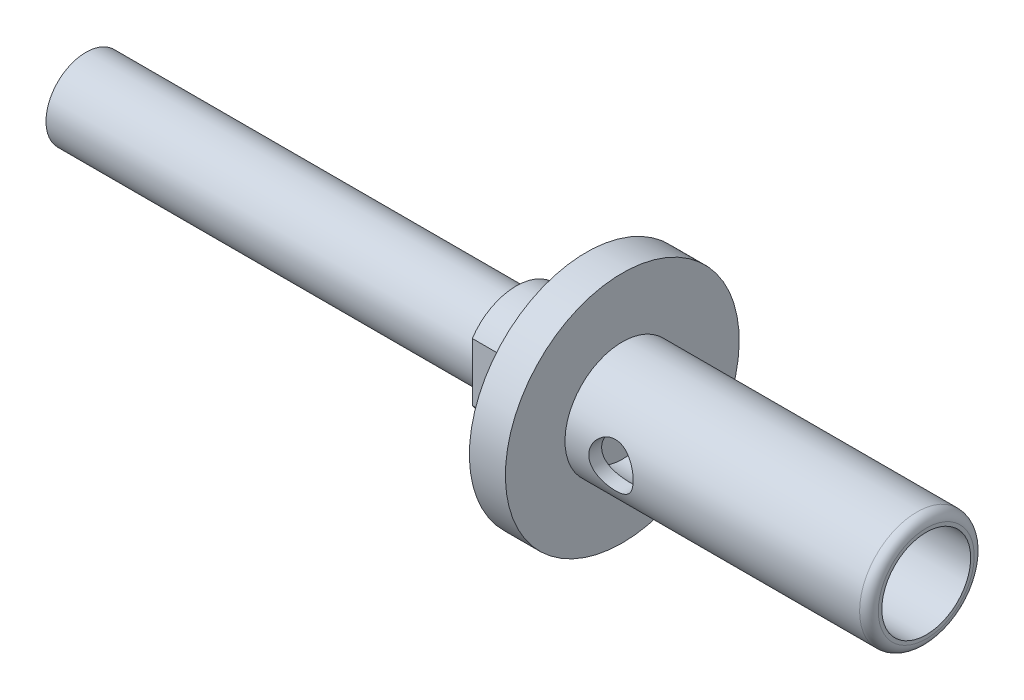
ISO-10303-21;
HEADER;
FILE_DESCRIPTION(('STEP AP214'),'2;1');
FILE_NAME('part.step','',(''),(''),'','','');
FILE_SCHEMA(('AUTOMOTIVE_DESIGN { 1 0 10303 214 1 1 1 1 }'));
ENDSEC;
DATA;
#1=APPLICATION_CONTEXT('core data for automotive mechanical design processes');
#2=APPLICATION_PROTOCOL_DEFINITION('international standard','automotive_design',2000,#1);
#3=PRODUCT_CONTEXT('',#1,'mechanical');
#4=PRODUCT('Part','Part','',(#3));
#5=PRODUCT_RELATED_PRODUCT_CATEGORY('part','',(#4));
#6=PRODUCT_DEFINITION_FORMATION('','',#4);
#7=PRODUCT_DEFINITION_CONTEXT('part definition',#1,'design');
#8=PRODUCT_DEFINITION('design','',#6,#7);
#9=PRODUCT_DEFINITION_SHAPE('','',#8);
#10=(LENGTH_UNIT() NAMED_UNIT(*) SI_UNIT(.MILLI.,.METRE.));
#11=(NAMED_UNIT(*) PLANE_ANGLE_UNIT() SI_UNIT($,.RADIAN.));
#12=(NAMED_UNIT(*) SI_UNIT($,.STERADIAN.) SOLID_ANGLE_UNIT());
#13=UNCERTAINTY_MEASURE_WITH_UNIT(LENGTH_MEASURE(1.E-05),#10,'distance_accuracy_value','');
#14=(GEOMETRIC_REPRESENTATION_CONTEXT(3) GLOBAL_UNCERTAINTY_ASSIGNED_CONTEXT((#13)) GLOBAL_UNIT_ASSIGNED_CONTEXT((#10,
#11,#12)) REPRESENTATION_CONTEXT('',''));
#15=CARTESIAN_POINT('',(0.,0.,0.));
#16=DIRECTION('',(0.,0.,1.));
#17=DIRECTION('',(1.,0.,0.));
#18=AXIS2_PLACEMENT_3D('',#15,#16,#17);
#19=CARTESIAN_POINT('',(0.,0.,0.));
#20=DIRECTION('',(1.,0.,0.));
#21=DIRECTION('',(0.,1.,0.));
#22=AXIS2_PLACEMENT_3D('',#19,#20,#21);
#23=PLANE('',#22);
#24=DIRECTION('',(0.,-1.,0.));
#25=VECTOR('',#24,1.);
#26=CARTESIAN_POINT('',(0.,-0.621867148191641,1.875));
#27=LINE('',#26,#25);
#28=CARTESIAN_POINT('',(0.,1.24373429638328,1.875));
#29=VERTEX_POINT('',#28);
#30=CARTESIAN_POINT('',(0.,-1.24373429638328,1.875));
#31=VERTEX_POINT('',#30);
#32=EDGE_CURVE('E188',#29,#31,#27,.T.);
#33=ORIENTED_EDGE('',*,*,#32,.T.);
#34=CARTESIAN_POINT('',(0.,0.,0.));
#35=DIRECTION('',(1.,0.,0.));
#36=DIRECTION('',(0.,-1.,0.));
#37=AXIS2_PLACEMENT_3D('',#34,#35,#36);
#38=CIRCLE('',#37,2.25);
#39=CARTESIAN_POINT('',(0.,-1.24373429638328,-1.875));
#40=VERTEX_POINT('',#39);
#41=EDGE_CURVE('E438',#31,#40,#38,.T.);
#42=ORIENTED_EDGE('',*,*,#41,.T.);
#43=DIRECTION('',(0.,1.,0.));
#44=VECTOR('',#43,1.);
#45=CARTESIAN_POINT('',(0.,0.621867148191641,-1.875));
#46=LINE('',#45,#44);
#47=CARTESIAN_POINT('',(0.,1.24373429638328,-1.875));
#48=VERTEX_POINT('',#47);
#49=EDGE_CURVE('E179',#40,#48,#46,.T.);
#50=ORIENTED_EDGE('',*,*,#49,.T.);
#51=CARTESIAN_POINT('',(0.,0.,0.));
#52=DIRECTION('',(1.,0.,0.));
#53=DIRECTION('',(0.,-1.,0.));
#54=AXIS2_PLACEMENT_3D('',#51,#52,#53);
#55=CIRCLE('',#54,2.25);
#56=EDGE_CURVE('E204',#48,#29,#55,.T.);
#57=ORIENTED_EDGE('',*,*,#56,.T.);
#58=EDGE_LOOP('',(#33,#42,#50,#57));
#59=FACE_BOUND('',#58,.T.);
#60=CARTESIAN_POINT('',(0.,0.,0.));
#61=DIRECTION('',(1.,0.,0.));
#62=DIRECTION('',(0.,1.,0.));
#63=AXIS2_PLACEMENT_3D('',#60,#61,#62);
#64=CIRCLE('',#63,5.);
#65=CARTESIAN_POINT('',(0.,-5.,0.));
#66=VERTEX_POINT('',#65);
#67=EDGE_CURVE('E11',#66,#66,#64,.T.);
#68=ORIENTED_EDGE('',*,*,#67,.F.);
#69=EDGE_LOOP('',(#68));
#70=FACE_BOUND('',#69,.T.);
#71=ADVANCED_FACE('F16',(#59,#70),#23,.F.);
#72=CARTESIAN_POINT('',(1.54,0.,0.));
#73=DIRECTION('',(1.,0.,0.));
#74=DIRECTION('',(0.,1.,0.));
#75=AXIS2_PLACEMENT_3D('',#72,#73,#74);
#76=PLANE('',#75);
#77=CARTESIAN_POINT('',(1.54,0.,0.));
#78=DIRECTION('',(1.,0.,0.));
#79=DIRECTION('',(0.,1.,0.));
#80=AXIS2_PLACEMENT_3D('',#77,#78,#79);
#81=CIRCLE('',#80,1.9);
#82=CARTESIAN_POINT('',(1.54,-1.9,0.));
#83=VERTEX_POINT('',#82);
#84=EDGE_CURVE('E482',#83,#83,#81,.T.);
#85=ORIENTED_EDGE('',*,*,#84,.T.);
#86=EDGE_LOOP('',(#85));
#87=FACE_BOUND('',#86,.T.);
#88=ADVANCED_FACE('F18',(#87),#76,.T.);
#89=CARTESIAN_POINT('',(0.,0.,0.));
#90=DIRECTION('',(1.,0.,0.));
#91=DIRECTION('',(0.,1.,0.));
#92=AXIS2_PLACEMENT_3D('',#89,#90,#91);
#93=CYLINDRICAL_SURFACE('',#92,5.);
#94=CARTESIAN_POINT('',(1.54,0.,0.));
#95=DIRECTION('',(1.,0.,0.));
#96=DIRECTION('',(0.,1.,0.));
#97=AXIS2_PLACEMENT_3D('',#94,#95,#96);
#98=CIRCLE('',#97,5.);
#99=CARTESIAN_POINT('',(1.54,-5.,0.));
#100=VERTEX_POINT('',#99);
#101=EDGE_CURVE('E171',#100,#100,#98,.T.);
#102=ORIENTED_EDGE('',*,*,#101,.F.);
#103=DIRECTION('',(-1.,0.,0.));
#104=VECTOR('',#103,1.);
#105=CARTESIAN_POINT('',(0.,-5.,0.));
#106=LINE('',#105,#104);
#107=EDGE_CURVE('E29',#100,#66,#106,.T.);
#108=ORIENTED_EDGE('',*,*,#107,.T.);
#109=ORIENTED_EDGE('',*,*,#67,.T.);
#110=ORIENTED_EDGE('',*,*,#107,.F.);
#111=EDGE_LOOP('',(#102,#108,#109,#110));
#112=FACE_BOUND('',#111,.T.);
#113=ADVANCED_FACE('F520',(#112),#93,.T.);
#114=CARTESIAN_POINT('',(1.54,0.,0.));
#115=DIRECTION('',(1.,0.,0.));
#116=DIRECTION('',(0.,1.,0.));
#117=AXIS2_PLACEMENT_3D('',#114,#115,#116);
#118=PLANE('',#117);
#119=CARTESIAN_POINT('',(1.54,0.,0.));
#120=DIRECTION('',(-1.,0.,0.));
#121=DIRECTION('',(0.,1.,0.));
#122=AXIS2_PLACEMENT_3D('',#119,#120,#121);
#123=CIRCLE('',#122,2.4505);
#124=CARTESIAN_POINT('',(1.54,-2.4505,0.));
#125=VERTEX_POINT('',#124);
#126=EDGE_CURVE('E149',#125,#125,#123,.T.);
#127=ORIENTED_EDGE('',*,*,#126,.T.);
#128=EDGE_LOOP('',(#127));
#129=FACE_BOUND('',#128,.T.);
#130=ORIENTED_EDGE('',*,*,#101,.T.);
#131=EDGE_LOOP('',(#130));
#132=FACE_BOUND('',#131,.T.);
#133=ADVANCED_FACE('F150',(#129,#132),#118,.T.);
#134=CARTESIAN_POINT('',(1.54,0.,0.));
#135=DIRECTION('',(1.,0.,0.));
#136=DIRECTION('',(0.,1.,0.));
#137=AXIS2_PLACEMENT_3D('',#134,#135,#136);
#138=CYLINDRICAL_SURFACE('',#137,1.9);
#139=CARTESIAN_POINT('',(3.50633054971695,0.950000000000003,1.64544826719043));
#140=CARTESIAN_POINT('',(3.49066911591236,0.94999244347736,1.64545187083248));
#141=CARTESIAN_POINT('',(3.47500742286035,0.949608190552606,1.64567444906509));
#142=CARTESIAN_POINT('',(3.44379850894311,0.948082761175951,1.64655413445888));
#143=CARTESIAN_POINT('',(3.42825108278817,0.946944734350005,1.64720943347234));
#144=CARTESIAN_POINT('',(3.39727059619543,0.943909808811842,1.64895031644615));
#145=CARTESIAN_POINT('',(3.38183743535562,0.942013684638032,1.65003546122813));
#146=CARTESIAN_POINT('',(3.35108539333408,0.937460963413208,1.65262635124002));
#147=CARTESIAN_POINT('',(3.33576682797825,0.934802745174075,1.65413299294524));
#148=CARTESIAN_POINT('',(3.30524346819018,0.928722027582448,1.65755470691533));
#149=CARTESIAN_POINT('',(3.29003970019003,0.925295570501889,1.65947189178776));
#150=CARTESIAN_POINT('',(3.25974523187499,0.917672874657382,1.66369938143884));
#151=CARTESIAN_POINT('',(3.24465652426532,0.913470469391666,1.66601282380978));
#152=CARTESIAN_POINT('',(3.21459094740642,0.904289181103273,1.67101427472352));
#153=CARTESIAN_POINT('',(3.19961723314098,0.899302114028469,1.67370619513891));
#154=CARTESIAN_POINT('',(3.16978127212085,0.888541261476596,1.67944397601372));
#155=CARTESIAN_POINT('',(3.15492348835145,0.882757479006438,1.68249424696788));
#156=CARTESIAN_POINT('',(3.12606684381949,0.870712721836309,1.68875808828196));
#157=CARTESIAN_POINT('',(3.11205608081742,0.864475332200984,1.69196229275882));
#158=CARTESIAN_POINT('',(3.08440553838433,0.851370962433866,1.69859392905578));
#159=CARTESIAN_POINT('',(3.07076537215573,0.84450467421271,1.70202111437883));
#160=CARTESIAN_POINT('',(3.04385628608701,0.830132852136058,1.7090768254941));
#161=CARTESIAN_POINT('',(3.03058785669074,0.822626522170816,1.71270560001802));
#162=CARTESIAN_POINT('',(3.00442106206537,0.806966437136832,1.7201396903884));
#163=CARTESIAN_POINT('',(2.99152420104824,0.79881044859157,1.72394559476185));
#164=CARTESIAN_POINT('',(2.96609958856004,0.781842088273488,1.73170739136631));
#165=CARTESIAN_POINT('',(2.95357446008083,0.773026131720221,1.73566403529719));
#166=CARTESIAN_POINT('',(2.92889212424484,0.754728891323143,1.74369863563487));
#167=CARTESIAN_POINT('',(2.91673872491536,0.745242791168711,1.74777731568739));
#168=CARTESIAN_POINT('',(2.89279880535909,0.725596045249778,1.75602535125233));
#169=CARTESIAN_POINT('',(2.88101730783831,0.715429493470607,1.7601952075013));
#170=CARTESIAN_POINT('',(2.85781945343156,0.694413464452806,1.76859252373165));
#171=CARTESIAN_POINT('',(2.84640931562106,0.683557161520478,1.77282006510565));
#172=CARTESIAN_POINT('',(2.82426170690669,0.661456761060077,1.78118296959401));
#173=CARTESIAN_POINT('',(2.81351725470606,0.650219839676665,1.78531880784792));
#174=CARTESIAN_POINT('',(2.79265928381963,0.62731844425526,1.79349327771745));
#175=CARTESIAN_POINT('',(2.78254135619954,0.615658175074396,1.79753242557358));
#176=CARTESIAN_POINT('',(2.76293513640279,0.591909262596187,1.80549142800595));
#177=CARTESIAN_POINT('',(2.7534433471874,0.579823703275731,1.80941186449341));
#178=CARTESIAN_POINT('',(2.73508857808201,0.555223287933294,1.81711103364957));
#179=CARTESIAN_POINT('',(2.72622315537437,0.542710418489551,1.82089028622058));
#180=CARTESIAN_POINT('',(2.70912001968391,0.517255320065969,1.8282839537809));
#181=CARTESIAN_POINT('',(2.7008810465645,0.504314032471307,1.83189869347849));
#182=CARTESIAN_POINT('',(2.68502949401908,0.478002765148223,1.83893959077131));
#183=CARTESIAN_POINT('',(2.67741693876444,0.464632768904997,1.84236574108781));
#184=CARTESIAN_POINT('',(2.66281732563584,0.437465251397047,1.84900516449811));
#185=CARTESIAN_POINT('',(2.65583164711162,0.423666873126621,1.85221796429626));
#186=CARTESIAN_POINT('',(2.64248287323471,0.395645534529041,1.85840559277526));
#187=CARTESIAN_POINT('',(2.636122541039,0.381421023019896,1.86137935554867));
#188=CARTESIAN_POINT('',(2.62398315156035,0.352438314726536,1.86708554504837));
#189=CARTESIAN_POINT('',(2.61821337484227,0.337675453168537,1.86981405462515));
#190=CARTESIAN_POINT('',(2.60745134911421,0.307977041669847,1.87493331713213));
#191=CARTESIAN_POINT('',(2.60245210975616,0.293044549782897,1.87732708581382));
#192=CARTESIAN_POINT('',(2.59322821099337,0.263015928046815,1.8817681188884));
#193=CARTESIAN_POINT('',(2.58899803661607,0.247921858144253,1.88381784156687));
#194=CARTESIAN_POINT('',(2.58131116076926,0.217578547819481,1.88756245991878));
#195=CARTESIAN_POINT('',(2.57785057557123,0.202330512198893,1.88925913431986));
#196=CARTESIAN_POINT('',(2.5717011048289,0.171688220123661,1.89228948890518));
#197=CARTESIAN_POINT('',(2.56901010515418,0.156294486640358,1.89362416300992));
#198=CARTESIAN_POINT('',(2.56439791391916,0.12536988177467,1.89592266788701));
#199=CARTESIAN_POINT('',(2.56247646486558,0.109839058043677,1.89688662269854));
#200=CARTESIAN_POINT('',(2.55940189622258,0.0786496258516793,1.89843576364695));
#201=CARTESIAN_POINT('',(2.55825041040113,0.0629908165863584,1.89902014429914));
#202=CARTESIAN_POINT('',(2.55671233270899,0.0315546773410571,1.89980351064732));
#203=CARTESIAN_POINT('',(2.55632923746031,0.0157771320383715,1.90000073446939));
#204=CARTESIAN_POINT('',(2.55633054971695,0.,1.9));
#205=B_SPLINE_CURVE_WITH_KNOTS('',3,(#139,#140,#141,#142,#143,#144,#145,#146,#147,#148,#149,
#150,#151,#152,#153,#154,#155,#156,#157,#158,#159,#160,#161,#162,#163,#164,#165,#166,#167,#168,
#169,#170,#171,#172,#173,#174,#175,#176,#177,#178,#179,#180,#181,#182,#183,#184,#185,#186,#187,
#188,#189,#190,#191,#192,#193,#194,#195,#196,#197,#198,#199,#200,#201,#202,#203,#204),
.UNSPECIFIED.,.F.,.F.,(4,2,2,2,2,2,2,2,2,2,2,2,2,2,2,2,2,2,2,2,2,2,2,2,2,2,2,2,2,2,2,2,4),(0.,
0.0469790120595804,0.0937629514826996,0.14049921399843,0.187335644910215,0.234419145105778,
0.281894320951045,0.329902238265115,0.37857932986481,0.42556387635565,0.472497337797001,
0.519490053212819,0.56665194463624,0.614091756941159,0.661916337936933,0.710229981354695,
0.759133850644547,0.80738022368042,0.855235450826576,0.902795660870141,0.95015877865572,
0.997423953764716,1.0446909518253,1.09205952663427,1.13962879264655,1.18785751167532,
1.23561904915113,1.28302327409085,1.33018255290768,1.37721100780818,1.42422371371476,
1.47133586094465,1.51866191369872),.UNSPECIFIED.);
#206=CARTESIAN_POINT('',(3.50633054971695,0.95,1.64544826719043));
#207=VERTEX_POINT('',#206);
#208=CARTESIAN_POINT('',(2.55633054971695,0.,1.9));
#209=VERTEX_POINT('',#208);
#210=EDGE_CURVE('E398',#207,#209,#205,.T.);
#211=ORIENTED_EDGE('',*,*,#210,.T.);
#212=CARTESIAN_POINT('',(2.55633054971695,0.,1.9));
#213=CARTESIAN_POINT('',(2.55633028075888,-0.0103574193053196,1.90000014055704));
#214=CARTESIAN_POINT('',(2.55650155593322,-0.0207148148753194,1.89991531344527));
#215=CARTESIAN_POINT('',(2.55718631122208,-0.0414166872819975,1.89957671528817));
#216=CARTESIAN_POINT('',(2.55769982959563,-0.0517611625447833,1.89932292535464));
#217=CARTESIAN_POINT('',(2.55906901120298,-0.072434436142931,1.89864698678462));
#218=CARTESIAN_POINT('',(2.55992508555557,-0.0827632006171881,1.89822463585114));
#219=CARTESIAN_POINT('',(2.56197892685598,-0.103402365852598,1.89721241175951));
#220=CARTESIAN_POINT('',(2.56317747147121,-0.113712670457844,1.89662215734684));
#221=CARTESIAN_POINT('',(2.56591589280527,-0.134312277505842,1.89527494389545));
#222=CARTESIAN_POINT('',(2.56745690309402,-0.144601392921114,1.89451743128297));
#223=CARTESIAN_POINT('',(2.57087996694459,-0.165156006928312,1.8928365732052));
#224=CARTESIAN_POINT('',(2.57276349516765,-0.175421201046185,1.89191251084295));
#225=CARTESIAN_POINT('',(2.57687099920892,-0.195925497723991,1.88989944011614));
#226=CARTESIAN_POINT('',(2.57909677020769,-0.206164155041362,1.88880956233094));
#227=CARTESIAN_POINT('',(2.58388942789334,-0.226612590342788,1.88646583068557));
#228=CARTESIAN_POINT('',(2.58645841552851,-0.236821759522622,1.8852109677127));
#229=CARTESIAN_POINT('',(2.59193350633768,-0.257209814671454,1.88253806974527));
#230=CARTESIAN_POINT('',(2.59484195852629,-0.267387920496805,1.88111889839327));
#231=CARTESIAN_POINT('',(2.60095148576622,-0.287515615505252,1.87814726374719));
#232=CARTESIAN_POINT('',(2.60414911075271,-0.297466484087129,1.87659638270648));
#233=CARTESIAN_POINT('',(2.61087623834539,-0.317244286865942,1.87335437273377));
#234=CARTESIAN_POINT('',(2.61440608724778,-0.327071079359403,1.87166309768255));
#235=CARTESIAN_POINT('',(2.62179363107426,-0.346600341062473,1.868145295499));
#236=CARTESIAN_POINT('',(2.62565200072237,-0.356302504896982,1.86631849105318));
#237=CARTESIAN_POINT('',(2.63369724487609,-0.375580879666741,1.86253477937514));
#238=CARTESIAN_POINT('',(2.63788511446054,-0.385156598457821,1.86057748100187));
#239=CARTESIAN_POINT('',(2.64658877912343,-0.404180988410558,1.85653782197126));
#240=CARTESIAN_POINT('',(2.651105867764,-0.413628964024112,1.85445497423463));
#241=CARTESIAN_POINT('',(2.66046774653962,-0.43239682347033,1.8501692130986));
#242=CARTESIAN_POINT('',(2.66531410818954,-0.441715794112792,1.847965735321));
#243=CARTESIAN_POINT('',(2.67533424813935,-0.460224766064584,1.84344364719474));
#244=CARTESIAN_POINT('',(2.68050985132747,-0.469413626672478,1.84112441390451));
#245=CARTESIAN_POINT('',(2.6911882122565,-0.487661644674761,1.83637567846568));
#246=CARTESIAN_POINT('',(2.69669302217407,-0.49671942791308,1.83394551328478));
#247=CARTESIAN_POINT('',(2.70802965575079,-0.514704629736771,1.82897973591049));
#248=CARTESIAN_POINT('',(2.71386373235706,-0.523630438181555,1.82644343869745));
#249=CARTESIAN_POINT('',(2.72556717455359,-0.540921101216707,1.82139566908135));
#250=CARTESIAN_POINT('',(2.73142580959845,-0.549294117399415,1.81888725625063));
#251=CARTESIAN_POINT('',(2.74336351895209,-0.565795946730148,1.81382167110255));
#252=CARTESIAN_POINT('',(2.74944128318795,-0.5739258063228,1.81126482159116));
#253=CARTESIAN_POINT('',(2.7618170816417,-0.589942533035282,1.80611136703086));
#254=CARTESIAN_POINT('',(2.76811402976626,-0.597830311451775,1.80351498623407));
#255=CARTESIAN_POINT('',(2.78092795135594,-0.613364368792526,1.79829115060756));
#256=CARTESIAN_POINT('',(2.78744406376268,-0.621011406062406,1.79566383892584));
#257=CARTESIAN_POINT('',(2.80069610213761,-0.636065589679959,1.79038655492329));
#258=CARTESIAN_POINT('',(2.80743139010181,-0.643473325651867,1.78773666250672));
#259=CARTESIAN_POINT('',(2.82112151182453,-0.658050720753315,1.78242231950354));
#260=CARTESIAN_POINT('',(2.82807592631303,-0.66522078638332,1.77975790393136));
#261=CARTESIAN_POINT('',(2.84220424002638,-0.679324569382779,1.77442242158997));
#262=CARTESIAN_POINT('',(2.84937793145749,-0.686258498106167,1.77175136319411));
#263=CARTESIAN_POINT('',(2.86394399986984,-0.699892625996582,1.76640989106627));
#264=CARTESIAN_POINT('',(2.87133637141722,-0.706592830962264,1.76373947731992));
#265=CARTESIAN_POINT('',(2.88634179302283,-0.719759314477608,1.75840753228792));
#266=CARTESIAN_POINT('',(2.89395502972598,-0.726225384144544,1.75574601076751));
#267=CARTESIAN_POINT('',(2.9098578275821,-0.739316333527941,1.75027561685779));
#268=CARTESIAN_POINT('',(2.91816007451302,-0.745926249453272,1.7474678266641));
#269=CARTESIAN_POINT('',(2.9348987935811,-0.758818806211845,1.74190780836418));
#270=CARTESIAN_POINT('',(2.94333323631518,-0.765103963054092,1.73915530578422));
#271=CARTESIAN_POINT('',(2.96033846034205,-0.777348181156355,1.73371690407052));
#272=CARTESIAN_POINT('',(2.96890742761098,-0.783309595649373,1.73103063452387));
#273=CARTESIAN_POINT('',(2.98618083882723,-0.794910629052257,1.72573388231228));
#274=CARTESIAN_POINT('',(2.99488371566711,-0.800552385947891,1.72312297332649));
#275=CARTESIAN_POINT('',(3.01242486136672,-0.811517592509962,1.71798591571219));
#276=CARTESIAN_POINT('',(3.02126180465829,-0.816842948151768,1.71545931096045));
#277=CARTESIAN_POINT('',(3.0390708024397,-0.827179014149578,1.71049921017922));
#278=CARTESIAN_POINT('',(3.04804177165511,-0.832191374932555,1.70806525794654));
#279=CARTESIAN_POINT('',(3.06611855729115,-0.841905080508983,1.70329826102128));
#280=CARTESIAN_POINT('',(3.07522352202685,-0.846607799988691,1.70096478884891));
#281=CARTESIAN_POINT('',(3.09356818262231,-0.855705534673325,1.69640615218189));
#282=CARTESIAN_POINT('',(3.10280724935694,-0.860101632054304,1.69418061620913));
#283=CARTESIAN_POINT('',(3.12141943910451,-0.8685903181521,1.6898442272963));
#284=CARTESIAN_POINT('',(3.13079214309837,-0.872683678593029,1.68773308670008));
#285=CARTESIAN_POINT('',(3.14994595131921,-0.880681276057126,1.68357398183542));
#286=CARTESIAN_POINT('',(3.15973121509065,-0.884577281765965,1.68152932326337));
#287=CARTESIAN_POINT('',(3.17939340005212,-0.892022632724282,1.67759150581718));
#288=CARTESIAN_POINT('',(3.18926941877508,-0.895573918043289,1.67569751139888));
#289=CARTESIAN_POINT('',(3.2091124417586,-0.902334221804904,1.67206686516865));
#290=CARTESIAN_POINT('',(3.21907878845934,-0.905544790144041,1.67032950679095));
#291=CARTESIAN_POINT('',(3.23910233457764,-0.911626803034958,1.66701785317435));
#292=CARTESIAN_POINT('',(3.24915909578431,-0.914499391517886,1.66544301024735));
#293=CARTESIAN_POINT('',(3.26936322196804,-0.919908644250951,1.66246130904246));
#294=CARTESIAN_POINT('',(3.27951034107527,-0.92244602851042,1.66105409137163));
#295=CARTESIAN_POINT('',(3.29989500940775,-0.927187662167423,1.65841201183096));
#296=CARTESIAN_POINT('',(3.31013247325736,-0.929392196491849,1.65717700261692));
#297=CARTESIAN_POINT('',(3.33069764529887,-0.933470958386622,1.6548829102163));
#298=CARTESIAN_POINT('',(3.34102539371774,-0.93534502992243,1.65382391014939));
#299=CARTESIAN_POINT('',(3.36177112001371,-0.93876428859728,1.65188543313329));
#300=CARTESIAN_POINT('',(3.37218922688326,-0.940308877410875,1.65100628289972));
#301=CARTESIAN_POINT('',(3.39311519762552,-0.943074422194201,1.64942813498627));
#302=CARTESIAN_POINT('',(3.4036232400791,-0.944294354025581,1.64872970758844));
#303=CARTESIAN_POINT('',(3.42443199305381,-0.946370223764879,1.64753900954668));
#304=CARTESIAN_POINT('',(3.43473164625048,-0.94723417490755,1.64704220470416));
#305=CARTESIAN_POINT('',(3.45782553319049,-0.948785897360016,1.64614894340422));
#306=CARTESIAN_POINT('',(3.47062823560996,-0.94938235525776,1.64580476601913));
#307=CARTESIAN_POINT('',(3.49104848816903,-0.949900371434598,1.64550579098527));
#308=CARTESIAN_POINT('',(3.49866070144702,-0.949997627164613,1.64544963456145));
#309=CARTESIAN_POINT('',(3.51391777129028,-0.94999785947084,1.64544950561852));
#310=CARTESIAN_POINT('',(3.52156262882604,-0.949900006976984,1.64550601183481));
#311=CARTESIAN_POINT('',(3.53688451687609,-0.949510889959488,1.64573057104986));
#312=CARTESIAN_POINT('',(3.54456151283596,-0.94921864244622,1.6458991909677));
#313=CARTESIAN_POINT('',(3.56510029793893,-0.948182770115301,1.64649628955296));
#314=CARTESIAN_POINT('',(3.57795102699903,-0.947267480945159,1.64702342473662));
#315=CARTESIAN_POINT('',(3.60367970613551,-0.944910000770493,1.64837706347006));
#316=CARTESIAN_POINT('',(3.61655720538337,-0.943464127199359,1.64920565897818));
#317=CARTESIAN_POINT('',(3.63973891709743,-0.940388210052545,1.65096108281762));
#318=CARTESIAN_POINT('',(3.65005897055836,-0.938847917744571,1.65183789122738));
#319=CARTESIAN_POINT('',(3.67071711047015,-0.935427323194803,1.65377738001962));
#320=CARTESIAN_POINT('',(3.68105458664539,-0.933544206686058,1.65484159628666));
#321=CARTESIAN_POINT('',(3.70170401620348,-0.929444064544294,1.65714794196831));
#322=CARTESIAN_POINT('',(3.71201550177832,-0.927225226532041,1.65839103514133));
#323=CARTESIAN_POINT('',(3.7325252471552,-0.922462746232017,1.66104482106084));
#324=CARTESIAN_POINT('',(3.74272365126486,-0.919919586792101,1.66245526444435));
#325=CARTESIAN_POINT('',(3.76300735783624,-0.914506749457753,1.66543896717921));
#326=CARTESIAN_POINT('',(3.77309268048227,-0.911637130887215,1.66701219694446));
#327=CARTESIAN_POINT('',(3.79315034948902,-0.905569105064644,1.67031629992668));
#328=CARTESIAN_POINT('',(3.80312255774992,-0.902370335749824,1.67204734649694));
#329=CARTESIAN_POINT('',(3.8229541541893,-0.895641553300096,1.67566130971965));
#330=CARTESIAN_POINT('',(3.83281321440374,-0.892110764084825,1.67754458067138));
#331=CARTESIAN_POINT('',(3.85241874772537,-0.884715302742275,1.68145662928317));
#332=CARTESIAN_POINT('',(3.86216467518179,-0.8808494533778,1.68348591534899));
#333=CARTESIAN_POINT('',(3.88154402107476,-0.872780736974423,1.68768319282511));
#334=CARTESIAN_POINT('',(3.89117665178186,-0.868576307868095,1.68985181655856));
#335=CARTESIAN_POINT('',(3.91033019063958,-0.859828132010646,1.69431988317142));
#336=CARTESIAN_POINT('',(3.91985005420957,-0.855282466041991,1.69662004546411));
#337=CARTESIAN_POINT('',(3.93877627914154,-0.845845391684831,1.7013446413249));
#338=CARTESIAN_POINT('',(3.94818130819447,-0.840951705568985,1.70376985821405));
#339=CARTESIAN_POINT('',(3.96649404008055,-0.831038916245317,1.70862627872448));
#340=CARTESIAN_POINT('',(3.97540782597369,-0.826029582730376,1.711054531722));
#341=CARTESIAN_POINT('',(3.99304440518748,-0.815756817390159,1.71597587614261));
#342=CARTESIAN_POINT('',(4.0017675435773,-0.810493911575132,1.71846882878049));
#343=CARTESIAN_POINT('',(4.01902087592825,-0.799708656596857,1.72351427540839));
#344=CARTESIAN_POINT('',(4.02755126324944,-0.794186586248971,1.72606670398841));
#345=CARTESIAN_POINT('',(4.04441981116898,-0.782881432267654,1.73122363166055));
#346=CARTESIAN_POINT('',(4.05275799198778,-0.777098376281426,1.73382812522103));
#347=CARTESIAN_POINT('',(4.06924215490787,-0.765268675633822,1.73908187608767));
#348=CARTESIAN_POINT('',(4.07738796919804,-0.75922181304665,1.74173116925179));
#349=CARTESIAN_POINT('',(4.09348762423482,-0.746862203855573,1.74706675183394));
#350=CARTESIAN_POINT('',(4.10144109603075,-0.74054900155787,1.74975309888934));
#351=CARTESIAN_POINT('',(4.11715627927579,-0.727654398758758,1.75515471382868));
#352=CARTESIAN_POINT('',(4.12491740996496,-0.721072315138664,1.7578700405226));
#353=CARTESIAN_POINT('',(4.14024804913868,-0.707637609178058,1.76332122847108));
#354=CARTESIAN_POINT('',(4.14781675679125,-0.700784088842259,1.76605712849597));
#355=CARTESIAN_POINT('',(4.1627630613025,-0.686804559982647,1.77154060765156));
#356=CARTESIAN_POINT('',(4.17013963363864,-0.679677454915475,1.77428818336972));
#357=CARTESIAN_POINT('',(4.18458107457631,-0.665267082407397,1.77974110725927));
#358=CARTESIAN_POINT('',(4.19164848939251,-0.657986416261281,1.78244658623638));
#359=CARTESIAN_POINT('',(4.20553601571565,-0.643209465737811,1.78783201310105));
#360=CARTESIAN_POINT('',(4.2123565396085,-0.635713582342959,1.79051199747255));
#361=CARTESIAN_POINT('',(4.22575076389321,-0.62050541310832,1.79583904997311));
#362=CARTESIAN_POINT('',(4.23232467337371,-0.612793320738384,1.79848614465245));
#363=CARTESIAN_POINT('',(4.24522579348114,-0.597151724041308,1.80373997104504));
#364=CARTESIAN_POINT('',(4.25155299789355,-0.589222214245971,1.80634670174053));
#365=CARTESIAN_POINT('',(4.26396096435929,-0.573145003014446,1.81151211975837));
#366=CARTESIAN_POINT('',(4.27004149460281,-0.564997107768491,1.81407076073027));
#367=CARTESIAN_POINT('',(4.28195626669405,-0.548482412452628,1.81913214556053));
#368=CARTESIAN_POINT('',(4.28779004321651,-0.540115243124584,1.82163477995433));
#369=CARTESIAN_POINT('',(4.29921179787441,-0.523161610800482,1.82657605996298));
#370=CARTESIAN_POINT('',(4.30479907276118,-0.514574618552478,1.82901451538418));
#371=CARTESIAN_POINT('',(4.3157271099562,-0.497180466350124,1.83381931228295));
#372=CARTESIAN_POINT('',(4.32106692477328,-0.488372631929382,1.83618536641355));
#373=CARTESIAN_POINT('',(4.331503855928,-0.470538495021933,1.84083645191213));
#374=CARTESIAN_POINT('',(4.33659979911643,-0.46151140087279,1.84312108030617));
#375=CARTESIAN_POINT('',(4.34658248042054,-0.443145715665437,1.8476234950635));
#376=CARTESIAN_POINT('',(4.35146505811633,-0.43380449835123,1.84983981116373));
#377=CARTESIAN_POINT('',(4.36089737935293,-0.414979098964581,1.8541534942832));
#378=CARTESIAN_POINT('',(4.36544842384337,-0.40549567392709,1.85625131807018));
#379=CARTESIAN_POINT('',(4.37422165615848,-0.38638908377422,1.86032217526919));
#380=CARTESIAN_POINT('',(4.37844483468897,-0.376766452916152,1.86229558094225));
#381=CARTESIAN_POINT('',(4.38656165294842,-0.357382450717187,1.86611230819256));
#382=CARTESIAN_POINT('',(4.39045597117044,-0.347621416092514,1.86795589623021));
#383=CARTESIAN_POINT('',(4.39791565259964,-0.327962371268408,1.87150750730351));
#384=CARTESIAN_POINT('',(4.40148136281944,-0.318064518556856,1.87321567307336));
#385=CARTESIAN_POINT('',(4.40828408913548,-0.298133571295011,1.87649097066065));
#386=CARTESIAN_POINT('',(4.41152110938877,-0.288100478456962,1.87805810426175));
#387=CARTESIAN_POINT('',(4.4176668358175,-0.267900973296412,1.88104582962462));
#388=CARTESIAN_POINT('',(4.42057519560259,-0.257734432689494,1.88246626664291));
#389=CARTESIAN_POINT('',(4.42606388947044,-0.237270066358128,1.885155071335));
#390=CARTESIAN_POINT('',(4.42864352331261,-0.2269720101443,1.88642311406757));
#391=CARTESIAN_POINT('',(4.43347533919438,-0.206246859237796,1.88880156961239));
#392=CARTESIAN_POINT('',(4.43572646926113,-0.195819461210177,1.88991147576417));
#393=CARTESIAN_POINT('',(4.43985022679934,-0.175092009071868,1.89194319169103));
#394=CARTESIAN_POINT('',(4.44172956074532,-0.164793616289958,1.89286833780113));
#395=CARTESIAN_POINT('',(4.44514485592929,-0.144193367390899,1.89454859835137));
#396=CARTESIAN_POINT('',(4.44668290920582,-0.133891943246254,1.89530474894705));
#397=CARTESIAN_POINT('',(4.44941614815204,-0.113288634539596,1.89664748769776));
#398=CARTESIAN_POINT('',(4.45061311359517,-0.10298704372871,1.89723495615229));
#399=CARTESIAN_POINT('',(4.45266444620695,-0.0823862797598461,1.89824086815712));
#400=CARTESIAN_POINT('',(4.45352026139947,-0.0720872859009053,1.8986600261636));
#401=CARTESIAN_POINT('',(4.45488962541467,-0.0514945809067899,1.89932990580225));
#402=CARTESIAN_POINT('',(4.45540427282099,-0.0412009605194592,1.89958116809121));
#403=CARTESIAN_POINT('',(4.45609173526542,-0.0206218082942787,1.89991589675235));
#404=CARTESIAN_POINT('',(4.45626528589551,-0.0103363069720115,1.89999972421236));
#405=CARTESIAN_POINT('',(4.45627061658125,0.0102238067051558,1.90000027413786));
#406=CARTESIAN_POINT('',(4.45610276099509,0.0204984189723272,1.89991717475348));
#407=CARTESIAN_POINT('',(4.45542679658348,0.0410341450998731,1.89958460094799));
#408=CARTESIAN_POINT('',(4.45491867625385,0.0512952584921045,1.89933512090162));
#409=CARTESIAN_POINT('',(4.45355829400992,0.0718008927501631,1.89867058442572));
#410=CARTESIAN_POINT('',(4.45270564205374,0.0820453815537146,1.89825534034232));
#411=CARTESIAN_POINT('',(4.45063703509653,0.102873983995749,1.89724264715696));
#412=CARTESIAN_POINT('',(4.44940875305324,0.113456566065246,1.89663899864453));
#413=CARTESIAN_POINT('',(4.44662066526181,0.134526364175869,1.89526085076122));
#414=CARTESIAN_POINT('',(4.44506211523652,0.145013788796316,1.89448699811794));
#415=CARTESIAN_POINT('',(4.44160939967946,0.165890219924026,1.89277305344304));
#416=CARTESIAN_POINT('',(4.43971615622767,0.176279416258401,1.89183341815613));
#417=CARTESIAN_POINT('',(4.43559558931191,0.19695710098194,1.88979248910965));
#418=CARTESIAN_POINT('',(4.43336882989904,0.207245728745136,1.88869146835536));
#419=CARTESIAN_POINT('',(4.42858127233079,0.227719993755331,1.88633234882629));
#420=CARTESIAN_POINT('',(4.42602068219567,0.23790569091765,1.88507434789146));
#421=CARTESIAN_POINT('',(4.42056591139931,0.258172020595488,1.88240583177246));
#422=CARTESIAN_POINT('',(4.41767158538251,0.26825260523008,1.88099525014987));
#423=CARTESIAN_POINT('',(4.41154965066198,0.288306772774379,1.87802611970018));
#424=CARTESIAN_POINT('',(4.40832155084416,0.298280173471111,1.87646735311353));
#425=CARTESIAN_POINT('',(4.40153250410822,0.318118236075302,1.87320636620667));
#426=CARTESIAN_POINT('',(4.39797073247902,0.327982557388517,1.87150379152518));
#427=CARTESIAN_POINT('',(4.39051435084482,0.34760071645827,1.86795970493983));
#428=CARTESIAN_POINT('',(4.38661859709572,0.357354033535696,1.86611771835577));
#429=CARTESIAN_POINT('',(4.37856539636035,0.376582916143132,1.8623319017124));
#430=CARTESIAN_POINT('',(4.37441186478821,0.38606043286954,1.86038964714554));
#431=CARTESIAN_POINT('',(4.36580169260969,0.404862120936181,1.85638873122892));
#432=CARTESIAN_POINT('',(4.36134479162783,0.414186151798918,1.85432997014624));
#433=CARTESIAN_POINT('',(4.35212786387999,0.432679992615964,1.85010220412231));
#434=CARTESIAN_POINT('',(4.34736729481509,0.441849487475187,1.84793300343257));
#435=CARTESIAN_POINT('',(4.33754338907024,0.46003373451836,1.84349038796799));
#436=CARTESIAN_POINT('',(4.33247924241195,0.469047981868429,1.84121669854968));
#437=CARTESIAN_POINT('',(4.32204843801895,0.486921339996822,1.8365710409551));
#438=CARTESIAN_POINT('',(4.3166807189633,0.495779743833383,1.83419873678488));
#439=CARTESIAN_POINT('',(4.30564296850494,0.513341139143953,1.82936169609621));
#440=CARTESIAN_POINT('',(4.29997164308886,0.522043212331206,1.82689657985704));
#441=CARTESIAN_POINT('',(4.28832710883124,0.539292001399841,1.8218795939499));
#442=CARTESIAN_POINT('',(4.28235239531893,0.547837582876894,1.81932731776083));
#443=CARTESIAN_POINT('',(4.27010052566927,0.5647728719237,1.81414182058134));
#444=CARTESIAN_POINT('',(4.26382167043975,0.573161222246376,1.81150818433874));
#445=CARTESIAN_POINT('',(4.25096458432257,0.589784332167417,1.80616477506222));
#446=CARTESIAN_POINT('',(4.24438450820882,0.598017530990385,1.80345458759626));
#447=CARTESIAN_POINT('',(4.23125538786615,0.613909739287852,1.79810513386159));
#448=CARTESIAN_POINT('',(4.2247170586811,0.621578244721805,1.79546779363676));
#449=CARTESIAN_POINT('',(4.21141742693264,0.636671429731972,1.79017130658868));
#450=CARTESIAN_POINT('',(4.20465679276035,0.644096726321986,1.78751224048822));
#451=CARTESIAN_POINT('',(4.19091556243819,0.658707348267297,1.78217983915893));
#452=CARTESIAN_POINT('',(4.18393540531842,0.665893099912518,1.77950654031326));
#453=CARTESIAN_POINT('',(4.16975460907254,0.680026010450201,1.77415379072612));
#454=CARTESIAN_POINT('',(4.16255419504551,0.686973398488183,1.77147434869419));
#455=CARTESIAN_POINT('',(4.14793329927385,0.70063176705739,1.7661169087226));
#456=CARTESIAN_POINT('',(4.14051283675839,0.707342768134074,1.76343891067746));
#457=CARTESIAN_POINT('',(4.12545199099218,0.720530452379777,1.7580917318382));
#458=CARTESIAN_POINT('',(4.11781143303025,0.727006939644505,1.75542256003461));
#459=CARTESIAN_POINT('',(4.10231061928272,0.739727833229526,1.75010009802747));
#460=CARTESIAN_POINT('',(4.09445000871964,0.745971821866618,1.74744684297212));
#461=CARTESIAN_POINT('',(4.07850920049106,0.758229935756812,1.74216303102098));
#462=CARTESIAN_POINT('',(4.07042848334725,0.764243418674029,1.73953255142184));
#463=CARTESIAN_POINT('',(4.05404785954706,0.776043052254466,1.73430071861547));
#464=CARTESIAN_POINT('',(4.04574728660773,0.781828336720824,1.7316994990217));
#465=CARTESIAN_POINT('',(4.02846469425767,0.793484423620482,1.72639099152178));
#466=CARTESIAN_POINT('',(4.01947146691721,0.79933992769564,1.72368656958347));
#467=CARTESIAN_POINT('',(4.00137749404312,0.810696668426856,1.71837417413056));
#468=CARTESIAN_POINT('',(3.99227891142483,0.816201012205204,1.71576548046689));
#469=CARTESIAN_POINT('',(3.97397468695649,0.826859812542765,1.71065409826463));
#470=CARTESIAN_POINT('',(3.9647709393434,0.832017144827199,1.70815062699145));
#471=CARTESIAN_POINT('',(3.94625660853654,0.84198592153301,1.70325872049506));
#472=CARTESIAN_POINT('',(3.9369476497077,0.846799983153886,1.70086947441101));
#473=CARTESIAN_POINT('',(3.91822317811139,0.856086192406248,1.6962143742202));
#474=CARTESIAN_POINT('',(3.90880902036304,0.860560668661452,1.69394771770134));
#475=CARTESIAN_POINT('',(3.88987444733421,0.869171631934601,1.68954547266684));
#476=CARTESIAN_POINT('',(3.88035512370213,0.873310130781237,1.68740912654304));
#477=CARTESIAN_POINT('',(3.86121038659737,0.881252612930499,1.68327471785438));
#478=CARTESIAN_POINT('',(3.85158581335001,0.885058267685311,1.68127597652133));
#479=CARTESIAN_POINT('',(3.83223119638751,0.892339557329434,1.67742272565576));
#480=CARTESIAN_POINT('',(3.82250175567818,0.895816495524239,1.67556765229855));
#481=CARTESIAN_POINT('',(3.80293627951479,0.902440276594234,1.67200946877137));
#482=CARTESIAN_POINT('',(3.79310063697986,0.905588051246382,1.67030593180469));
#483=CARTESIAN_POINT('',(3.77305619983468,0.911651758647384,1.66700428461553));
#484=CARTESIAN_POINT('',(3.762844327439,0.914559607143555,1.66541003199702));
#485=CARTESIAN_POINT('',(3.74240911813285,0.920026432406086,1.66239616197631));
#486=CARTESIAN_POINT('',(3.73218683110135,0.922588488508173,1.66097501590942));
#487=CARTESIAN_POINT('',(3.71172968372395,0.927363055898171,1.65831395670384));
#488=CARTESIAN_POINT('',(3.70149565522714,0.929578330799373,1.65707261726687));
#489=CARTESIAN_POINT('',(3.68101561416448,0.933662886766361,1.65477462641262));
#490=CARTESIAN_POINT('',(3.67077021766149,0.935534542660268,1.65371671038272));
#491=CARTESIAN_POINT('',(3.65026755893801,0.93893393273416,1.65178898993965));
#492=CARTESIAN_POINT('',(3.64001072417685,0.940463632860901,1.65091811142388));
#493=CARTESIAN_POINT('',(3.61948540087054,0.94318118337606,1.64936705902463));
#494=CARTESIAN_POINT('',(3.6092171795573,0.944370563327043,1.64868603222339));
#495=CARTESIAN_POINT('',(3.58866923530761,0.946409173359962,1.64751662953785));
#496=CARTESIAN_POINT('',(3.57838965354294,0.947259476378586,1.64702764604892));
#497=CARTESIAN_POINT('',(3.55781910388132,0.94862120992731,1.64624374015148));
#498=CARTESIAN_POINT('',(3.5475281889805,0.949133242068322,1.64594847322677));
#499=CARTESIAN_POINT('',(3.52693508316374,0.949819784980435,1.64555230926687));
#500=CARTESIAN_POINT('',(3.51663289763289,0.949994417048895,1.6454513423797));
#501=CARTESIAN_POINT('',(3.50633054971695,0.950000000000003,1.64544826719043));
#502=B_SPLINE_CURVE_WITH_KNOTS('',3,(#212,#213,#214,#215,#216,#217,#218,#219,#220,#221,#222,
#223,#224,#225,#226,#227,#228,#229,#230,#231,#232,#233,#234,#235,#236,#237,#238,#239,#240,#241,
#242,#243,#244,#245,#246,#247,#248,#249,#250,#251,#252,#253,#254,#255,#256,#257,#258,#259,#260,
#261,#262,#263,#264,#265,#266,#267,#268,#269,#270,#271,#272,#273,#274,#275,#276,#277,#278,#279,
#280,#281,#282,#283,#284,#285,#286,#287,#288,#289,#290,#291,#292,#293,#294,#295,#296,#297,#298,
#299,#300,#301,#302,#303,#304,#305,#306,#307,#308,#309,#310,#311,#312,#313,#314,#315,#316,#317,
#318,#319,#320,#321,#322,#323,#324,#325,#326,#327,#328,#329,#330,#331,#332,#333,#334,#335,#336,
#337,#338,#339,#340,#341,#342,#343,#344,#345,#346,#347,#348,#349,#350,#351,#352,#353,#354,#355,
#356,#357,#358,#359,#360,#361,#362,#363,#364,#365,#366,#367,#368,#369,#370,#371,#372,#373,#374,
#375,#376,#377,#378,#379,#380,#381,#382,#383,#384,#385,#386,#387,#388,#389,#390,#391,#392,#393,
#394,#395,#396,#397,#398,#399,#400,#401,#402,#403,#404,#405,#406,#407,#408,#409,#410,#411,#412,
#413,#414,#415,#416,#417,#418,#419,#420,#421,#422,#423,#424,#425,#426,#427,#428,#429,#430,#431,
#432,#433,#434,#435,#436,#437,#438,#439,#440,#441,#442,#443,#444,#445,#446,#447,#448,#449,#450,
#451,#452,#453,#454,#455,#456,#457,#458,#459,#460,#461,#462,#463,#464,#465,#466,#467,#468,#469,
#470,#471,#472,#473,#474,#475,#476,#477,#478,#479,#480,#481,#482,#483,#484,#485,#486,#487,#488,
#489,#490,#491,#492,#493,#494,#495,#496,#497,#498,#499,#500,#501),.UNSPECIFIED.,.F.,.F.,(4,2,2,
2,2,2,2,2,2,2,2,2,2,2,2,2,2,2,2,2,2,2,2,2,2,2,2,2,2,2,2,2,2,2,2,2,2,2,2,2,2,2,2,2,2,2,2,2,2,2,2,
2,2,2,2,2,2,2,2,2,2,2,2,2,2,2,2,2,2,2,2,2,2,2,2,2,2,2,2,2,2,2,2,2,2,2,2,2,2,2,2,2,2,2,2,2,2,2,2,
2,2,2,2,2,2,2,2,2,2,2,2,2,2,2,2,2,2,2,2,2,2,2,2,2,2,2,2,2,2,2,2,2,2,2,2,2,2,2,2,2,2,2,2,2,4),
(0.,0.0310704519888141,0.0621443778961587,0.0932557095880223,0.124438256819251,
0.155725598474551,0.187150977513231,0.218747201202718,0.250546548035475,0.282580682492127,
0.31427331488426,0.345999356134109,0.377792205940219,0.409685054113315,0.441710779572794,
0.473901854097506,0.506290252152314,0.538907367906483,0.571783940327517,0.603346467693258,
0.634744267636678,0.666004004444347,0.697152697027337,0.728217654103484,0.759226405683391,
0.790206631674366,0.821186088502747,0.852192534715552,0.885119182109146,0.917732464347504,
0.950063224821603,0.982143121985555,1.01400456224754,1.04568062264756,1.077204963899,
1.10861173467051,1.13993546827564,1.17211566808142,1.20410274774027,1.23593744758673,
1.26766109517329,1.29931545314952,1.33094255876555,1.36258455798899,1.39428353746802,
1.4260813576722,1.45711810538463,1.49556508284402,1.51840138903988,1.54133493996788,
1.56438534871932,1.60305226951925,1.64199280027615,1.67339951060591,1.70507672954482,
1.73693149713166,1.76873938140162,1.80054149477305,1.83237897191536,1.86429281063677,
1.89632371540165,1.92851194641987,1.96089717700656,1.99351836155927,2.02504125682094,
2.05650136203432,2.08792836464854,2.11935204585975,2.1508021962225,2.18230853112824,
2.21390060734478,2.24560774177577,2.27745893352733,2.30895761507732,2.34040099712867,
2.37181708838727,2.40323397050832,2.43467972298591,2.46618234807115,2.49776969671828,
2.52946939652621,2.56130878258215,2.59361478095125,2.62578629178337,2.65785646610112,
2.68985876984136,2.72182688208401,2.75379458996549,2.78579568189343,2.81786384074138,
2.85003253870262,2.88155374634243,2.91287603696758,2.94403176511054,2.97505380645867,
3.00597546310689,3.03683036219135,3.0676523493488,3.09847537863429,3.12933340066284,
3.16133852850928,3.19322408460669,3.22502312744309,3.2567689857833,3.28849515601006,
3.32023519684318,3.35202262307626,3.38389080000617,3.41587284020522,3.44745194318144,
3.47905850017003,3.51072317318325,3.54247645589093,3.57434858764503,3.60636947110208,
3.63856859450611,3.67097495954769,3.7036170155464,3.73486263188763,3.76602162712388,
3.79712183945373,3.82819126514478,3.85925798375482,3.89035008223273,3.92149557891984,
3.95272234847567,3.98405804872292,4.01725329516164,4.05009525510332,4.08261868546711,
4.11485937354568,4.14685405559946,4.17864032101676,4.21025650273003,4.24174155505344,
4.27313492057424,4.3053388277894,4.33723378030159,4.36885996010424,4.40025858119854,
4.4314717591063,4.46254236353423,4.49351385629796,4.52443011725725,4.55533526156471),.UNSPECIFIED.);
#503=EDGE_CURVE('E125',#209,#207,#502,.T.);
#504=ORIENTED_EDGE('',*,*,#503,.T.);
#505=EDGE_LOOP('',(#211,#504));
#506=FACE_BOUND('',#505,.T.);
#507=CARTESIAN_POINT('',(3.50633054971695,0.950000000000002,-1.64544826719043));
#508=CARTESIAN_POINT('',(3.51662970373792,0.949994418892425,-1.64545134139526));
#509=CARTESIAN_POINT('',(3.5269286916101,0.949819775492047,-1.64555231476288));
#510=CARTESIAN_POINT('',(3.54751620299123,0.949133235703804,-1.64594847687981));
#511=CARTESIAN_POINT('',(3.55780471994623,0.948621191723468,-1.64624375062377));
#512=CARTESIAN_POINT('',(3.57837127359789,0.947259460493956,-1.64702765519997));
#513=CARTESIAN_POINT('',(3.5886492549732,0.946409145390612,-1.64751664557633));
#514=CARTESIAN_POINT('',(3.60919479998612,0.944370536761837,-1.6486860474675));
#515=CARTESIAN_POINT('',(3.61946221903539,0.943181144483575,-1.64936708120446));
#516=CARTESIAN_POINT('',(3.63998674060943,0.940463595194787,-1.65091813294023));
#517=CARTESIAN_POINT('',(3.65024357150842,0.93893388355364,-1.65178901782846));
#518=CARTESIAN_POINT('',(3.67074702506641,0.93553449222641,-1.65371673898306));
#519=CARTESIAN_POINT('',(3.6809932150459,0.933662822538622,-1.65477466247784));
#520=CARTESIAN_POINT('',(3.70147565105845,0.929578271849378,-1.65707265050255));
#521=CARTESIAN_POINT('',(3.71171127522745,0.927362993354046,-1.65831399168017));
#522=CARTESIAN_POINT('',(3.73217240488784,0.922588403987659,-1.66097506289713));
#523=CARTESIAN_POINT('',(3.74239707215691,0.920026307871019,-1.66239623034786));
#524=CARTESIAN_POINT('',(3.76283790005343,0.914559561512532,-1.66541005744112));
#525=CARTESIAN_POINT('',(3.77305300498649,0.911651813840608,-1.66700425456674));
#526=CARTESIAN_POINT('',(3.79309505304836,0.905590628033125,-1.67030452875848));
#527=CARTESIAN_POINT('',(3.80292517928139,0.902445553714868,-1.6720066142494));
#528=CARTESIAN_POINT('',(3.82248097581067,0.895826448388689,-1.67556232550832));
#529=CARTESIAN_POINT('',(3.83220623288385,0.892351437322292,-1.67741640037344));
#530=CARTESIAN_POINT('',(3.85155390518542,0.885073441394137,-1.68126798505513));
#531=CARTESIAN_POINT('',(3.86117569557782,0.881269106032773,-1.68326607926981));
#532=CARTESIAN_POINT('',(3.88031627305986,0.873328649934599,-1.68739953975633));
#533=CARTESIAN_POINT('',(3.88983419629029,0.869190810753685,-1.68953560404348));
#534=CARTESIAN_POINT('',(3.90876738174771,0.860580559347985,-1.69393761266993));
#535=CARTESIAN_POINT('',(3.91818152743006,0.856106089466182,-1.69620433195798));
#536=CARTESIAN_POINT('',(3.93690738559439,0.846819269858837,-1.70085987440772));
#537=CARTESIAN_POINT('',(3.94621771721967,0.842004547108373,-1.70324951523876));
#538=CARTESIAN_POINT('',(3.9647362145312,0.832033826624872,-1.70814250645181));
#539=CARTESIAN_POINT('',(3.97394272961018,0.826875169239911,-1.71064668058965));
#540=CARTESIAN_POINT('',(3.99225387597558,0.816213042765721,-1.71575976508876));
#541=CARTESIAN_POINT('',(4.00135658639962,0.810706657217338,-1.71836946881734));
#542=CARTESIAN_POINT('',(4.01946033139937,0.799345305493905,-1.72368408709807));
#543=CARTESIAN_POINT('',(4.02845917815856,0.793487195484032,-1.72638972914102));
#544=CARTESIAN_POINT('',(4.04574275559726,0.781832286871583,-1.7316977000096));
#545=CARTESIAN_POINT('',(4.0540389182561,0.776051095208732,-1.73429710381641));
#546=CARTESIAN_POINT('',(4.07041176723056,0.76425859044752,-1.73952587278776));
#547=CARTESIAN_POINT('',(4.07848909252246,0.758248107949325,-1.74215510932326));
#548=CARTESIAN_POINT('',(4.09442429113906,0.745995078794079,-1.74743690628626));
#549=CARTESIAN_POINT('',(4.10228265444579,0.739753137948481,-1.75008939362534));
#550=CARTESIAN_POINT('',(4.11778011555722,0.727035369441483,-1.75541078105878));
#551=CARTESIAN_POINT('',(4.12541953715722,0.720559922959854,-1.75807964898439));
#552=CARTESIAN_POINT('',(4.14047926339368,0.707373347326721,-1.76342664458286));
#553=CARTESIAN_POINT('',(4.14789971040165,0.700662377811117,-1.76610476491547));
#554=CARTESIAN_POINT('',(4.16252172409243,0.687003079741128,-1.77146284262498));
#555=CARTESIAN_POINT('',(4.16972323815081,0.68005469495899,-1.77414280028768));
#556=CARTESIAN_POINT('',(4.18390739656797,0.66591879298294,-1.77949693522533));
#557=CARTESIAN_POINT('',(4.19088978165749,0.658731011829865,-1.78217110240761));
#558=CARTESIAN_POINT('',(4.20463658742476,0.644115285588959,-1.78750556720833));
#559=CARTESIAN_POINT('',(4.21140053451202,0.636686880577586,-1.79016582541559));
#560=CARTESIAN_POINT('',(4.22470807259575,0.621586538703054,-1.79546494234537));
#561=CARTESIAN_POINT('',(4.23125096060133,0.613913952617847,-1.79810371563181));
#562=CARTESIAN_POINT('',(4.24438108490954,0.598022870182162,-1.80345279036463));
#563=CARTESIAN_POINT('',(4.25095790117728,0.589795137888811,-1.80616121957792));
#564=CARTESIAN_POINT('',(4.26380920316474,0.573181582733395,-1.81150172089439));
#565=CARTESIAN_POINT('',(4.27008549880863,0.564797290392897,-1.81413419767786));
#566=CARTESIAN_POINT('',(4.28233316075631,0.547868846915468,-1.81931788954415));
#567=CARTESIAN_POINT('',(4.28830618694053,0.539326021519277,-1.82186950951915));
#568=CARTESIAN_POINT('',(4.29994821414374,0.522081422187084,-1.82688565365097));
#569=CARTESIAN_POINT('',(4.30561867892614,0.513380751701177,-1.82935057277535));
#570=CARTESIAN_POINT('',(4.31665559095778,0.49582083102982,-1.83418763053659));
#571=CARTESIAN_POINT('',(4.32202328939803,0.486962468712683,-1.83656013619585));
#572=CARTESIAN_POINT('',(4.3324549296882,0.469087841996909,-1.84120655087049));
#573=CARTESIAN_POINT('',(4.33751988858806,0.460072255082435,-1.84348078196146));
#574=CARTESIAN_POINT('',(4.34734631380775,0.441883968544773,-1.84792477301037));
#575=CARTESIAN_POINT('',(4.35210854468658,0.432711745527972,-1.850094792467));
#576=CARTESIAN_POINT('',(4.36132963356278,0.414211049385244,-1.85432443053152));
#577=CARTESIAN_POINT('',(4.36578898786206,0.404882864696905,-1.85638422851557));
#578=CARTESIAN_POINT('',(4.37440512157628,0.386071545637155,-1.86038737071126));
#579=CARTESIAN_POINT('',(4.37856211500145,0.37658852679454,-1.86233079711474));
#580=CARTESIAN_POINT('',(4.3866169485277,0.357360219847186,-1.86611650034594));
#581=CARTESIAN_POINT('',(4.39051125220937,0.347613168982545,-1.86795735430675));
#582=CARTESIAN_POINT('',(4.39796499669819,0.328005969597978,-1.87149966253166));
#583=CARTESIAN_POINT('',(4.401525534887,0.318146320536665,-1.8732015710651));
#584=CARTESIAN_POINT('',(4.40831260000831,0.298316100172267,-1.8764616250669));
#585=CARTESIAN_POINT('',(4.41153990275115,0.288345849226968,-1.87802010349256));
#586=CARTESIAN_POINT('',(4.41766067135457,0.268296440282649,-1.88098898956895));
#587=CARTESIAN_POINT('',(4.42055457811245,0.258217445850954,-1.88239959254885));
#588=CARTESIAN_POINT('',(4.42600895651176,0.237952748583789,-1.88506840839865));
#589=CARTESIAN_POINT('',(4.42856952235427,0.227767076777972,-1.88632666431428));
#590=CARTESIAN_POINT('',(4.4333574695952,0.207291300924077,-1.88868647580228));
#591=CARTESIAN_POINT('',(4.43558459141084,0.197001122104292,-1.88978790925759));
#592=CARTESIAN_POINT('',(4.43970633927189,0.176318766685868,-1.89182976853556));
#593=CARTESIAN_POINT('',(4.44160034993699,0.165926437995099,-1.89276989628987));
#594=CARTESIAN_POINT('',(4.44505499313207,0.145042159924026,-1.89448485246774));
#595=CARTESIAN_POINT('',(4.44661465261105,0.134550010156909,-1.8952591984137));
#596=CARTESIAN_POINT('',(4.4494055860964,0.1134692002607,-1.89663827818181));
#597=CARTESIAN_POINT('',(4.45063555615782,0.10288032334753,-1.89724233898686));
#598=CARTESIAN_POINT('',(4.45270585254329,0.0820514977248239,-1.89825504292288));
#599=CARTESIAN_POINT('',(4.4535589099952,0.0718131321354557,-1.89867008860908));
#600=CARTESIAN_POINT('',(4.45491990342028,0.0513182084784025,-1.89933447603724));
#601=CARTESIAN_POINT('',(4.45542817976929,0.0410616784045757,-1.89958398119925));
#602=CARTESIAN_POINT('',(4.45610448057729,0.0205335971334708,-1.8999167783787));
#603=CARTESIAN_POINT('',(4.45627246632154,0.0102620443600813,-1.90000005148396));
#604=CARTESIAN_POINT('',(4.45626736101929,-0.0102934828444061,-1.89999994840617));
#605=CARTESIAN_POINT('',(4.45609385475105,-0.0205774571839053,-1.89991636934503));
#606=CARTESIAN_POINT('',(4.45540646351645,-0.0411550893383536,-1.89958216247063));
#607=CARTESIAN_POINT('',(4.45489179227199,-0.0514487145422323,-1.89933114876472));
#608=CARTESIAN_POINT('',(4.45352235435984,-0.0720429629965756,-1.89866171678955));
#609=CARTESIAN_POINT('',(4.45266643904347,-0.0823434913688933,-1.89824273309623));
#610=CARTESIAN_POINT('',(4.45061489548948,-0.102948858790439,-1.89723704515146));
#611=CARTESIAN_POINT('',(4.44941777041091,-0.113253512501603,-1.89664960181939));
#612=CARTESIAN_POINT('',(4.44668414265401,-0.133864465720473,-1.89530671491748));
#613=CARTESIAN_POINT('',(4.44514581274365,-0.144170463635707,-1.89455036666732));
#614=CARTESIAN_POINT('',(4.44173010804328,-0.164781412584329,-1.89286943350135));
#615=CARTESIAN_POINT('',(4.43985059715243,-0.175085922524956,-1.89194378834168));
#616=CARTESIAN_POINT('',(4.43572850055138,-0.195813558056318,-1.88991205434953));
#617=CARTESIAN_POINT('',(4.4334795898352,-0.206235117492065,-1.88880281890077));
#618=CARTESIAN_POINT('',(4.42865155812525,-0.226950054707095,-1.88642573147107));
#619=CARTESIAN_POINT('',(4.42607344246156,-0.23724372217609,-1.88515836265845));
#620=CARTESIAN_POINT('',(4.42058735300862,-0.257700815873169,-1.88247085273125));
#621=CARTESIAN_POINT('',(4.41768003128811,-0.26786445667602,-1.88105101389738));
#622=CARTESIAN_POINT('',(4.41153589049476,-0.288059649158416,-1.87806435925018));
#623=CARTESIAN_POINT('',(4.40829936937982,-0.298091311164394,-1.8764976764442));
#624=CARTESIAN_POINT('',(4.40149716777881,-0.31802087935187,-1.8732230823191));
#625=CARTESIAN_POINT('',(4.39793143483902,-0.327918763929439,-1.87151514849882));
#626=CARTESIAN_POINT('',(4.39047122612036,-0.347579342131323,-1.86796373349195));
#627=CARTESIAN_POINT('',(4.38657635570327,-0.357341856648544,-1.86612008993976));
#628=CARTESIAN_POINT('',(4.37845796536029,-0.376730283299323,-1.8623029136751));
#629=CARTESIAN_POINT('',(4.37423372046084,-0.386355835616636,-1.86032909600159));
#630=CARTESIAN_POINT('',(4.36545783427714,-0.405469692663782,-1.85625701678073));
#631=CARTESIAN_POINT('',(4.36090515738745,-0.41495743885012,-1.85415836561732));
#632=CARTESIAN_POINT('',(4.35146924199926,-0.433792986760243,-1.84984254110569));
#633=CARTESIAN_POINT('',(4.34658465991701,-0.443140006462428,-1.84762489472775));
#634=CARTESIAN_POINT('',(4.33660352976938,-0.461506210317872,-1.84312235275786));
#635=CARTESIAN_POINT('',(4.33151148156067,-0.47052823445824,-1.84083904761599));
#636=CARTESIAN_POINT('',(4.32108127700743,-0.488353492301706,-1.83619043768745));
#637=CARTESIAN_POINT('',(4.31574425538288,-0.497157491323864,-1.83382552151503));
#638=CARTESIAN_POINT('',(4.30482093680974,-0.514545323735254,-1.82902274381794));
#639=CARTESIAN_POINT('',(4.29923554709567,-0.523129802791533,-1.82658515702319));
#640=CARTESIAN_POINT('',(4.28781664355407,-0.540079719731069,-1.82164530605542));
#641=CARTESIAN_POINT('',(4.28198379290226,-0.548445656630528,-1.81914322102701));
#642=CARTESIAN_POINT('',(4.27006996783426,-0.564959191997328,-1.8140825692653));
#643=CARTESIAN_POINT('',(4.26398941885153,-0.573107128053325,-1.81152410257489));
#644=CARTESIAN_POINT('',(4.25158050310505,-0.589185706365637,-1.80635861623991));
#645=CARTESIAN_POINT('',(4.24525232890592,-0.597116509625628,-1.80375163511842));
#646=CARTESIAN_POINT('',(4.2323483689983,-0.612761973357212,-1.79849683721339));
#647=CARTESIAN_POINT('',(4.22577255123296,-0.620476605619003,-1.79584901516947));
#648=CARTESIAN_POINT('',(4.21237356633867,-0.635691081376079,-1.79052000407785));
#649=CARTESIAN_POINT('',(4.20555015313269,-0.643190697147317,-1.78783878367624));
#650=CARTESIAN_POINT('',(4.19165606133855,-0.657976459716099,-1.78245028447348));
#651=CARTESIAN_POINT('',(4.18458493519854,-0.665262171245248,-1.77974296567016));
#652=CARTESIAN_POINT('',(4.17014463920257,-0.679673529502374,-1.77428966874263));
#653=CARTESIAN_POINT('',(4.16277320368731,-0.686796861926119,-1.77154357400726));
#654=CARTESIAN_POINT('',(4.14783581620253,-0.700769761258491,-1.76606280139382));
#655=CARTESIAN_POINT('',(4.14027085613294,-0.70762038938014,-1.76332812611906));
#656=CARTESIAN_POINT('',(4.12494651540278,-0.721050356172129,-1.75787903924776));
#657=CARTESIAN_POINT('',(4.11718790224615,-0.727630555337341,-1.7551645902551));
#658=CARTESIAN_POINT('',(4.10147651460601,-0.740522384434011,-1.74976435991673));
#659=CARTESIAN_POINT('',(4.09352428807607,-0.746834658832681,-1.74707852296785));
#660=CARTESIAN_POINT('',(4.0774258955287,-0.759193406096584,-1.74174355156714));
#661=CARTESIAN_POINT('',(4.0692800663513,-0.765240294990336,-1.73909436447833));
#662=CARTESIAN_POINT('',(4.05279463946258,-0.777071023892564,-1.73384038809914));
#663=CARTESIAN_POINT('',(4.04445517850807,-0.7828550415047,-1.73123556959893));
#664=CARTESIAN_POINT('',(4.02758284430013,-0.794163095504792,-1.72607751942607));
#665=CARTESIAN_POINT('',(4.01904992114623,-0.799687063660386,-1.72352430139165));
#666=CARTESIAN_POINT('',(4.00179025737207,-0.810477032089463,-1.71847680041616));
#667=CARTESIAN_POINT('',(3.99306329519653,-0.815742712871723,-1.71598259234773));
#668=CARTESIAN_POINT('',(3.97541792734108,-0.826022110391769,-1.71105815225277));
#669=CARTESIAN_POINT('',(3.96649915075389,-0.831035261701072,-1.70862806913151));
#670=CARTESIAN_POINT('',(3.94818706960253,-0.8409495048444,-1.70377093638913));
#671=CARTESIAN_POINT('',(3.93878789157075,-0.845841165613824,-1.7013467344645));
#672=CARTESIAN_POINT('',(3.91987185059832,-0.855274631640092,-1.69662399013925));
#673=CARTESIAN_POINT('',(3.91035629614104,-0.859818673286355,-1.69432467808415));
#674=CARTESIAN_POINT('',(3.89120997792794,-0.868564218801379,-1.68985802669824));
#675=CARTESIAN_POINT('',(3.88158023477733,-0.872767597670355,-1.68768998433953));
#676=CARTESIAN_POINT('',(3.86220523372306,-0.880834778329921,-1.68349359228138));
#677=CARTESIAN_POINT('',(3.85246074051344,-0.884700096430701,-1.68146462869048));
#678=CARTESIAN_POINT('',(3.83285665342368,-0.892095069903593,-1.67755292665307));
#679=CARTESIAN_POINT('',(3.82299758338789,-0.895625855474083,-1.67566970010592));
#680=CARTESIAN_POINT('',(3.8031645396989,-0.902355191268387,-1.67205552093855));
#681=CARTESIAN_POINT('',(3.79319087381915,-0.905554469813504,-1.67032423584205));
#682=CARTESIAN_POINT('',(3.77312886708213,-0.911624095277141,-1.66701932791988));
#683=CARTESIAN_POINT('',(3.76304064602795,-0.914494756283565,-1.66544555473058));
#684=CARTESIAN_POINT('',(3.74274969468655,-0.919910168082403,-1.6624604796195));
#685=CARTESIAN_POINT('',(3.73254692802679,-0.922454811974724,-1.66104923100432));
#686=CARTESIAN_POINT('',(3.71202709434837,-0.927221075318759,-1.65839335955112));
#687=CARTESIAN_POINT('',(3.70170986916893,-0.92944216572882,-1.65714900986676));
#688=CARTESIAN_POINT('',(3.68106545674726,-0.933542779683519,-1.65484239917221));
#689=CARTESIAN_POINT('',(3.67073887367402,-0.935424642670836,-1.65377889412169));
#690=CARTESIAN_POINT('',(3.65009629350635,-0.938843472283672,-1.65184041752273));
#691=CARTESIAN_POINT('',(3.63978086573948,-0.940383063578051,-1.65096401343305));
#692=CARTESIAN_POINT('',(3.61660088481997,-0.943458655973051,-1.6492087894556));
#693=CARTESIAN_POINT('',(3.60372044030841,-0.944904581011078,-1.6483801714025));
#694=CARTESIAN_POINT('',(3.57797627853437,-0.947264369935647,-1.64702521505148));
#695=CARTESIAN_POINT('',(3.56511296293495,-0.948181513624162,-1.64649701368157));
#696=CARTESIAN_POINT('',(3.54457505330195,-0.94921832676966,-1.64589937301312));
#697=CARTESIAN_POINT('',(3.53691160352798,-0.949510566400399,-1.64573075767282));
#698=CARTESIAN_POINT('',(3.52160326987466,-0.949899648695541,-1.64550621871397));
#699=CARTESIAN_POINT('',(3.51395840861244,-0.949997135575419,-1.6454499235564));
#700=CARTESIAN_POINT('',(3.49868778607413,-0.949997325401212,-1.64544980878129));
#701=CARTESIAN_POINT('',(3.49106202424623,-0.949900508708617,-1.64550571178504));
#702=CARTESIAN_POINT('',(3.47064361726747,-0.949383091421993,-1.64580434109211));
#703=CARTESIAN_POINT('',(3.45785628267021,-0.948787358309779,-1.64614810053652));
#704=CARTESIAN_POINT('',(3.43476232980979,-0.947236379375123,-1.64704093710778));
#705=CARTESIAN_POINT('',(3.42444734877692,-0.946371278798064,-1.64753840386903));
#706=CARTESIAN_POINT('',(3.40362961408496,-0.944295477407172,-1.6487290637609));
#707=CARTESIAN_POINT('',(3.39312782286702,-0.943077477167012,-1.64942638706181));
#708=CARTESIAN_POINT('',(3.37221283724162,-0.940314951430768,-1.65100282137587));
#709=CARTESIAN_POINT('',(3.36179947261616,-0.938771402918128,-1.65188138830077));
#710=CARTESIAN_POINT('',(3.34106162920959,-0.935354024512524,-1.65381882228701));
#711=CARTESIAN_POINT('',(3.33073703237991,-0.933480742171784,-1.65487739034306));
#712=CARTESIAN_POINT('',(3.3101765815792,-0.929403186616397,-1.65717083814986));
#713=CARTESIAN_POINT('',(3.29994070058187,-0.927199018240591,-1.65840566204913));
#714=CARTESIAN_POINT('',(3.27955760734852,-0.922457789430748,-1.66104756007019));
#715=CARTESIAN_POINT('',(3.26941049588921,-0.91992039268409,-1.66245480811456));
#716=CARTESIAN_POINT('',(3.2492047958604,-0.914510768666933,-1.66543676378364));
#717=CARTESIAN_POINT('',(3.23914647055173,-0.911637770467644,-1.66701185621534));
#718=CARTESIAN_POINT('',(3.2191181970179,-0.90555460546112,-1.67032418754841));
#719=CARTESIAN_POINT('',(3.20914870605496,-0.902343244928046,-1.67206199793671));
#720=CARTESIAN_POINT('',(3.18929782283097,-0.895580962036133,-1.67569374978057));
#721=CARTESIAN_POINT('',(3.17941710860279,-0.892028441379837,-1.67758841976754));
#722=CARTESIAN_POINT('',(3.15974385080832,-0.884580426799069,-1.68152767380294));
#723=CARTESIAN_POINT('',(3.14995223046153,-0.880682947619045,-1.68357311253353));
#724=CARTESIAN_POINT('',(3.1307977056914,-0.872686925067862,-1.68773139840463));
#725=CARTESIAN_POINT('',(3.12143045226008,-0.868596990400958,-1.6898407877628));
#726=CARTESIAN_POINT('',(3.10282784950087,-0.860114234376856,-1.69417420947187));
#727=CARTESIAN_POINT('',(3.09359294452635,-0.855720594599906,-1.69639854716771));
#728=CARTESIAN_POINT('',(3.07525518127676,-0.846627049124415,-1.70095520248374));
#729=CARTESIAN_POINT('',(3.0661529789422,-0.841926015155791,-1.70328790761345));
#730=CARTESIAN_POINT('',(3.04808032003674,-0.832214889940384,-1.70805379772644));
#731=CARTESIAN_POINT('',(3.03911074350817,-0.827203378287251,-1.71048742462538));
#732=CARTESIAN_POINT('',(3.02130312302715,-0.816868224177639,-1.71544727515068));
#733=CARTESIAN_POINT('',(3.01246619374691,-0.811542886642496,-1.71797396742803));
#734=CARTESIAN_POINT('',(2.99492367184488,-0.800576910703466,-1.7231115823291));
#735=CARTESIAN_POINT('',(2.98621943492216,-0.794934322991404,-1.72572297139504));
#736=CARTESIAN_POINT('',(2.96894188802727,-0.783330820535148,-1.73102103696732));
#737=CARTESIAN_POINT('',(2.96037017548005,-0.777367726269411,-1.73370814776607));
#738=CARTESIAN_POINT('',(2.94335808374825,-0.765119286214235,-1.73914857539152));
#739=CARTESIAN_POINT('',(2.93491954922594,-0.758831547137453,-1.74190226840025));
#740=CARTESIAN_POINT('',(2.91817112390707,-0.745933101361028,-1.74746491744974));
#741=CARTESIAN_POINT('',(2.90986329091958,-0.739319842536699,-1.75027415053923));
#742=CARTESIAN_POINT('',(2.89395916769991,-0.72622972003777,-1.75574419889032));
#743=CARTESIAN_POINT('',(2.88634993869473,-0.719768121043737,-1.75840390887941));
#744=CARTESIAN_POINT('',(2.87135159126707,-0.706609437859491,-1.76373280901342));
#745=CARTESIAN_POINT('',(2.86396231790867,-0.699912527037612,-1.7664019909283));
#746=CARTESIAN_POINT('',(2.8494013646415,-0.686283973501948,-1.77174148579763));
#747=CARTESIAN_POINT('',(2.84222972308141,-0.679352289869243,-1.7744117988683));
#748=CARTESIAN_POINT('',(2.8281044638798,-0.665251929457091,-1.77974625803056));
#749=CARTESIAN_POINT('',(2.82115108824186,-0.658083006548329,-1.78241039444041));
#750=CARTESIAN_POINT('',(2.80746198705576,-0.643506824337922,-1.78772460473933));
#751=CARTESIAN_POINT('',(2.80072671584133,-0.636099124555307,-1.79037464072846));
#752=CARTESIAN_POINT('',(2.78747365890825,-0.621043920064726,-1.79565259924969));
#753=CARTESIAN_POINT('',(2.78095654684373,-0.613395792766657,-1.79828043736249));
#754=CARTESIAN_POINT('',(2.76813956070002,-0.597858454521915,-1.80350566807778));
#755=CARTESIAN_POINT('',(2.76184058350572,-0.589968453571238,-1.80610291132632));
#756=CARTESIAN_POINT('',(2.74945970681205,-0.573946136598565,-1.81125839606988));
#757=CARTESIAN_POINT('',(2.74337892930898,-0.565812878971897,-1.81381640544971));
#758=CARTESIAN_POINT('',(2.73143400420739,-0.549303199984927,-1.81888453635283));
#759=CARTESIAN_POINT('',(2.72557120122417,-0.540925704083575,-1.82139432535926));
#760=CARTESIAN_POINT('',(2.71386646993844,-0.523635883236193,-1.82644184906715));
#761=CARTESIAN_POINT('',(2.70803496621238,-0.514715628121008,-1.82897661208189));
#762=CARTESIAN_POINT('',(2.69670291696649,-0.49674013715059,-1.83393988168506));
#763=CARTESIAN_POINT('',(2.69120015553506,-0.487686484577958,-1.83636905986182));
#764=CARTESIAN_POINT('',(2.68052514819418,-0.46944542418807,-1.8411162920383));
#765=CARTESIAN_POINT('',(2.67535089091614,-0.460259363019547,-1.84343499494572));
#766=CARTESIAN_POINT('',(2.66533274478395,-0.441754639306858,-1.84795644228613));
#767=CARTESIAN_POINT('',(2.66048707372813,-0.43243709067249,-1.85015979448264));
#768=CARTESIAN_POINT('',(2.65112586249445,-0.413670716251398,-1.85444566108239));
#769=CARTESIAN_POINT('',(2.6466087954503,-0.404222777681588,-1.85652872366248));
#770=CARTESIAN_POINT('',(2.63790446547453,-0.385197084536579,-1.86056910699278));
#771=CARTESIAN_POINT('',(2.63371595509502,-0.375620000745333,-1.8625268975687));
#772=CARTESIAN_POINT('',(2.62566870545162,-0.356337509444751,-1.86631182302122));
#773=CARTESIAN_POINT('',(2.62180901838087,-0.34663257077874,-1.86813933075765));
#774=CARTESIAN_POINT('',(2.6144181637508,-0.327096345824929,-1.87165870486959));
#775=CARTESIAN_POINT('',(2.61088636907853,-0.317265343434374,-1.87335082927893));
#776=CARTESIAN_POINT('',(2.60415449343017,-0.29747775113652,-1.87659462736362));
#777=CARTESIAN_POINT('',(2.60095411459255,-0.28752128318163,-1.87814642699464));
#778=CARTESIAN_POINT('',(2.59484201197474,-0.267391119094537,-1.88111842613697));
#779=CARTESIAN_POINT('',(2.59193345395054,-0.25721624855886,-1.88253717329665));
#780=CARTESIAN_POINT('',(2.58645827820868,-0.236833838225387,-1.88520943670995));
#781=CARTESIAN_POINT('',(2.58388933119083,-0.226627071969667,-1.88646407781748));
#782=CARTESIAN_POINT('',(2.57909669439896,-0.206182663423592,-1.88880753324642));
#783=CARTESIAN_POINT('',(2.5768709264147,-0.195945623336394,-1.88989734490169));
#784=CARTESIAN_POINT('',(2.57276341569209,-0.175443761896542,-1.89191041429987));
#785=CARTESIAN_POINT('',(2.57087990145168,-0.165179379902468,-1.89283452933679));
#786=CARTESIAN_POINT('',(2.56745683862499,-0.144625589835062,-1.89451558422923));
#787=CARTESIAN_POINT('',(2.56591584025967,-0.134336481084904,-1.89527322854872));
#788=CARTESIAN_POINT('',(2.56317741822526,-0.11373608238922,-1.89662075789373));
#789=CARTESIAN_POINT('',(2.56197888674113,-0.103424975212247,-1.89721118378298));
#790=CARTESIAN_POINT('',(2.55992504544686,-0.0827833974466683,-1.89822376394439));
#791=CARTESIAN_POINT('',(2.55906898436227,-0.0724530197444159,-1.89864628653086));
#792=CARTESIAN_POINT('',(2.55769980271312,-0.0517757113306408,-1.899322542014));
#793=CARTESIAN_POINT('',(2.55718629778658,-0.041428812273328,-1.89957646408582));
#794=CARTESIAN_POINT('',(2.55650154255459,-0.0207212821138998,-1.89991526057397));
#795=CARTESIAN_POINT('',(2.55633028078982,-0.0103606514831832,-1.90000014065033));
#796=CARTESIAN_POINT('',(2.55633054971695,0.,-1.9));
#797=B_SPLINE_CURVE_WITH_KNOTS('',3,(#507,#508,#509,#510,#511,#512,#513,#514,#515,#516,#517,
#518,#519,#520,#521,#522,#523,#524,#525,#526,#527,#528,#529,#530,#531,#532,#533,#534,#535,#536,
#537,#538,#539,#540,#541,#542,#543,#544,#545,#546,#547,#548,#549,#550,#551,#552,#553,#554,#555,
#556,#557,#558,#559,#560,#561,#562,#563,#564,#565,#566,#567,#568,#569,#570,#571,#572,#573,#574,
#575,#576,#577,#578,#579,#580,#581,#582,#583,#584,#585,#586,#587,#588,#589,#590,#591,#592,#593,
#594,#595,#596,#597,#598,#599,#600,#601,#602,#603,#604,#605,#606,#607,#608,#609,#610,#611,#612,
#613,#614,#615,#616,#617,#618,#619,#620,#621,#622,#623,#624,#625,#626,#627,#628,#629,#630,#631,
#632,#633,#634,#635,#636,#637,#638,#639,#640,#641,#642,#643,#644,#645,#646,#647,#648,#649,#650,
#651,#652,#653,#654,#655,#656,#657,#658,#659,#660,#661,#662,#663,#664,#665,#666,#667,#668,#669,
#670,#671,#672,#673,#674,#675,#676,#677,#678,#679,#680,#681,#682,#683,#684,#685,#686,#687,#688,
#689,#690,#691,#692,#693,#694,#695,#696,#697,#698,#699,#700,#701,#702,#703,#704,#705,#706,#707,
#708,#709,#710,#711,#712,#713,#714,#715,#716,#717,#718,#719,#720,#721,#722,#723,#724,#725,#726,
#727,#728,#729,#730,#731,#732,#733,#734,#735,#736,#737,#738,#739,#740,#741,#742,#743,#744,#745,
#746,#747,#748,#749,#750,#751,#752,#753,#754,#755,#756,#757,#758,#759,#760,#761,#762,#763,#764,
#765,#766,#767,#768,#769,#770,#771,#772,#773,#774,#775,#776,#777,#778,#779,#780,#781,#782,#783,
#784,#785,#786,#787,#788,#789,#790,#791,#792,#793,#794,#795,#796),.UNSPECIFIED.,.F.,.F.,(4,2,2,
2,2,2,2,2,2,2,2,2,2,2,2,2,2,2,2,2,2,2,2,2,2,2,2,2,2,2,2,2,2,2,2,2,2,2,2,2,2,2,2,2,2,2,2,2,2,2,2,
2,2,2,2,2,2,2,2,2,2,2,2,2,2,2,2,2,2,2,2,2,2,2,2,2,2,2,2,2,2,2,2,2,2,2,2,2,2,2,2,2,2,2,2,2,2,2,2,
2,2,2,2,2,2,2,2,2,2,2,2,2,2,2,2,2,2,2,2,2,2,2,2,2,2,2,2,2,2,2,2,2,2,2,2,2,2,2,2,2,2,2,2,2,4),
(0.,0.0308955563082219,0.0618046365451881,0.0927713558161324,0.123839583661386,
0.155052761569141,0.186453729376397,0.218084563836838,0.249986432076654,0.282199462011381,
0.313574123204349,0.3450450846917,0.376651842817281,0.40843338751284,0.440428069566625,
0.472673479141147,0.505206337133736,0.538062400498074,0.571276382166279,0.602593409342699,
0.633806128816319,0.664942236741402,0.696029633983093,0.72709635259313,0.758170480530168,
0.789280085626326,0.820453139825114,0.851717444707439,0.884339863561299,0.916731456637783,
0.948920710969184,0.980936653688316,1.01280878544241,1.04456700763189,1.07624154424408,
1.1078628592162,1.13946157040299,1.17142423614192,1.20327782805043,1.23505550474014,
1.26679066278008,1.29851683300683,1.3302675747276,1.36207636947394,1.39397651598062,
1.42600102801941,1.45684083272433,1.48765014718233,1.51846296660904,1.54931327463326,
1.58023493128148,1.6112615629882,1.64242645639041,1.67376245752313,1.70530187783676,
1.73745193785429,1.76950606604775,1.80149777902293,1.83346078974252,1.86542890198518,
1.89743590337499,1.92951545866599,1.96170100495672,1.99402565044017,2.02584563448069,
2.05753073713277,2.08910833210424,2.12060607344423,2.15205182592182,2.18347359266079,
2.21489944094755,2.24635742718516,2.27787552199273,2.30970725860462,2.34139975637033,
2.37298205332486,2.40448349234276,2.43593364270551,2.46736221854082,2.4987989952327,
2.53027372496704,2.56181605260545,2.59441863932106,2.62678986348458,2.65896872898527,
2.69099494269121,2.72290878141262,2.75475094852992,2.78656242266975,2.81838430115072,
2.8502576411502,2.88190197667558,2.91329457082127,2.95224392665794,2.99094902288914,
3.01395881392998,3.03689236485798,3.05976928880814,3.09817009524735,3.1292530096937,
3.16103137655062,3.19271569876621,3.22434789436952,3.2559700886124,3.28762444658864,
3.31935300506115,3.35119750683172,3.38319924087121,3.41539889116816,3.44670285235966,
3.47809473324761,3.50960911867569,3.54128019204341,3.5731416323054,3.60522651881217,
3.63756724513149,3.67019544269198,3.70314191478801,3.73412971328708,3.76509514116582,
3.79606599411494,3.82707005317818,3.85813501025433,3.88928839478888,3.9205575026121,
3.95196932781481,3.9835504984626,4.01640832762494,4.04901133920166,4.08139031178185,
4.11357666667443,4.1456023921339,4.17749995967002,4.20930223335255,4.24104237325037,
4.27275373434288,4.30477853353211,4.33657082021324,4.36816230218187,4.3995852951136,
4.4308726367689,4.46205759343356,4.49317375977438,4.52425495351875,4.55533510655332),.UNSPECIFIED.);
#798=CARTESIAN_POINT('',(3.50633054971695,0.95,-1.64544826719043));
#799=VERTEX_POINT('',#798);
#800=CARTESIAN_POINT('',(2.55633054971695,0.,-1.9));
#801=VERTEX_POINT('',#800);
#802=EDGE_CURVE('E386',#799,#801,#797,.T.);
#803=ORIENTED_EDGE('',*,*,#802,.T.);
#804=CARTESIAN_POINT('',(2.55633054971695,0.,-1.9));
#805=CARTESIAN_POINT('',(2.55632923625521,0.0157733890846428,-1.90000073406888));
#806=CARTESIAN_POINT('',(2.55671235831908,0.0315471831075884,-1.89980360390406));
#807=CARTESIAN_POINT('',(2.55825043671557,0.0629769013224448,-1.89902058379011));
#808=CARTESIAN_POINT('',(2.55940194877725,0.0786330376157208,-1.89843642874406));
#809=CARTESIAN_POINT('',(2.56247651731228,0.109818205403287,-1.89688781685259));
#810=CARTESIAN_POINT('',(2.56439799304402,0.125347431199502,-1.8959241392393));
#811=CARTESIAN_POINT('',(2.56901018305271,0.156269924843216,-1.89362618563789));
#812=CARTESIAN_POINT('',(2.57170120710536,0.171663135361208,-1.89229176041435));
#813=CARTESIAN_POINT('',(2.57785067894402,0.202305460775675,-1.8892618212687));
#814=CARTESIAN_POINT('',(2.58131129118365,0.217554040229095,-1.88756528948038));
#815=CARTESIAN_POINT('',(2.58899815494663,0.247899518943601,-1.88382079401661));
#816=CARTESIAN_POINT('',(2.59322833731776,0.26299519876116,-1.88177102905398));
#817=CARTESIAN_POINT('',(2.60245226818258,0.293028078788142,-1.87732967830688));
#818=CARTESIAN_POINT('',(2.60745157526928,0.307963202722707,-1.87493561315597));
#819=CARTESIAN_POINT('',(2.61821345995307,0.337668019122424,-1.86981542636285));
#820=CARTESIAN_POINT('',(2.62398306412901,0.352434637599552,-1.86708626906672));
#821=CARTESIAN_POINT('',(2.63611852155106,0.381414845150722,-1.8613805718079));
#822=CARTESIAN_POINT('',(2.64247463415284,0.395633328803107,-1.85840814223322));
#823=CARTESIAN_POINT('',(2.65581628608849,0.423644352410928,-1.85222308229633));
#824=CARTESIAN_POINT('',(2.66279914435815,0.437438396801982,-1.84901148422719));
#825=CARTESIAN_POINT('',(2.67739413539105,0.464599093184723,-1.84237421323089));
#826=CARTESIAN_POINT('',(2.68500497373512,0.477966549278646,-1.83894898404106));
#827=CARTESIAN_POINT('',(2.70085418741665,0.504274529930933,-1.83190956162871));
#828=CARTESIAN_POINT('',(2.70909262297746,0.517215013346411,-1.82829535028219));
#829=CARTESIAN_POINT('',(2.72619576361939,0.542670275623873,-1.82090225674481));
#830=CARTESIAN_POINT('',(2.73506181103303,0.555184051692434,-1.81712302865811));
#831=CARTESIAN_POINT('',(2.75341889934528,0.579788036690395,-1.80942331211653));
#832=CARTESIAN_POINT('',(2.76291246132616,0.591876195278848,-1.80550228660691));
#833=CARTESIAN_POINT('',(2.78252337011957,0.615631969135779,-1.797541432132));
#834=CARTESIAN_POINT('',(2.79264428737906,0.627296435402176,-1.79350100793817));
#835=CARTESIAN_POINT('',(2.81350912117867,0.650208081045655,-1.78532313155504));
#836=CARTESIAN_POINT('',(2.82425751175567,0.661450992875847,-1.78118515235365));
#837=CARTESIAN_POINT('',(2.84640336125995,0.683552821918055,-1.77282170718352));
#838=CARTESIAN_POINT('',(2.85780732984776,0.694405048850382,-1.76859579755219));
#839=CARTESIAN_POINT('',(2.88099472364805,0.715414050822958,-1.7602014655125));
#840=CARTESIAN_POINT('',(2.89277198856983,0.725577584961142,-1.75603295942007));
#841=CARTESIAN_POINT('',(2.91670504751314,0.745219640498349,-1.74778717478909));
#842=CARTESIAN_POINT('',(2.92885588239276,0.754703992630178,-1.74370940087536));
#843=CARTESIAN_POINT('',(2.95353476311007,0.772998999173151,-1.73567611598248));
#844=CARTESIAN_POINT('',(2.96605906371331,0.78181439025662,-1.73171989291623));
#845=CARTESIAN_POINT('',(2.99148367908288,0.798782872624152,-1.72395837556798));
#846=CARTESIAN_POINT('',(3.00438143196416,0.806939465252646,-1.72015234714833));
#847=CARTESIAN_POINT('',(3.03055166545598,0.822602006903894,-1.71271738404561));
#848=CARTESIAN_POINT('',(3.04382269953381,0.830110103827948,-1.70908788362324));
#849=CARTESIAN_POINT('',(3.07073869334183,0.844486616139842,-1.70203008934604));
#850=CARTESIAN_POINT('',(3.08438321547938,0.851355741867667,-1.69860157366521));
#851=CARTESIAN_POINT('',(3.11204402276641,0.864467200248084,-1.69196646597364));
#852=CARTESIAN_POINT('',(3.12606074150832,0.870708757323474,-1.68876015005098));
#853=CARTESIAN_POINT('',(3.15491975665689,0.882757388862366,-1.68249429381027));
#854=CARTESIAN_POINT('',(3.16977372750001,0.888541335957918,-1.67944393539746));
#855=CARTESIAN_POINT('',(3.19960323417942,0.899302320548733,-1.67370608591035));
#856=CARTESIAN_POINT('',(3.21457432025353,0.904289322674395,-1.67101419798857));
#857=CARTESIAN_POINT('',(3.2446356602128,0.913470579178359,-1.66601276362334));
#858=CARTESIAN_POINT('',(3.25972277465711,0.917672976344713,-1.66369932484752));
#859=CARTESIAN_POINT('',(3.29001511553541,0.925295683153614,-1.65947182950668));
#860=CARTESIAN_POINT('',(3.30521836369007,0.928722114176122,-1.65755465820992));
#861=CARTESIAN_POINT('',(3.33574173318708,0.934802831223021,-1.65413294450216));
#862=CARTESIAN_POINT('',(3.35106084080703,0.937461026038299,-1.65262631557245));
#863=CARTESIAN_POINT('',(3.38181502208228,0.942013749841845,-1.65003542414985));
#864=CARTESIAN_POINT('',(3.39724978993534,0.943909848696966,-1.64895029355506));
#865=CARTESIAN_POINT('',(3.42823454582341,0.946944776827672,-1.64720940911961));
#866=CARTESIAN_POINT('',(3.44378464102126,0.948082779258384,-1.64655412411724));
#867=CARTESIAN_POINT('',(3.47499995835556,0.949608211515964,-1.64567443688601));
#868=CARTESIAN_POINT('',(3.49066538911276,0.949992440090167,-1.64545187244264));
#869=CARTESIAN_POINT('',(3.50633054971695,0.950000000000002,-1.64544826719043));
#870=B_SPLINE_CURVE_WITH_KNOTS('',3,(#804,#805,#806,#807,#808,#809,#810,#811,#812,#813,#814,
#815,#816,#817,#818,#819,#820,#821,#822,#823,#824,#825,#826,#827,#828,#829,#830,#831,#832,#833,
#834,#835,#836,#837,#838,#839,#840,#841,#842,#843,#844,#845,#846,#847,#848,#849,#850,#851,#852,
#853,#854,#855,#856,#857,#858,#859,#860,#861,#862,#863,#864,#865,#866,#867,#868,#869),
.UNSPECIFIED.,.F.,.F.,(4,2,2,2,2,2,2,2,2,2,2,2,2,2,2,2,2,2,2,2,2,2,2,2,2,2,2,2,2,2,2,2,4),(0.,
0.0473148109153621,0.0944189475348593,0.141426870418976,0.188453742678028,0.235614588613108,
0.283023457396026,0.330792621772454,0.37903183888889,0.426579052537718,0.473931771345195,
0.52118921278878,0.568451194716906,0.615817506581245,0.663387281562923,0.711258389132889,
0.759526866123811,0.808408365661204,0.856705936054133,0.904520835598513,0.951957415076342,
0.999122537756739,1.04612491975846,1.09307440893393,1.1400812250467,1.18874805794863,
1.23674848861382,1.28421908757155,1.33130103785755,1.37813903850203,1.42488005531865,
1.4716719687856,1.51866217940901),.UNSPECIFIED.);
#871=EDGE_CURVE('E229',#801,#799,#870,.T.);
#872=ORIENTED_EDGE('',*,*,#871,.T.);
#873=EDGE_LOOP('',(#803,#872));
#874=FACE_BOUND('',#873,.T.);
#875=ORIENTED_EDGE('',*,*,#84,.F.);
#876=DIRECTION('',(1.,0.,0.));
#877=VECTOR('',#876,1.);
#878=CARTESIAN_POINT('',(1.54,-1.9,0.));
#879=LINE('',#878,#877);
#880=CARTESIAN_POINT('',(14.54,-1.9,0.));
#881=VERTEX_POINT('',#880);
#882=EDGE_CURVE('E175',#83,#881,#879,.T.);
#883=ORIENTED_EDGE('',*,*,#882,.T.);
#884=CARTESIAN_POINT('',(14.54,0.,0.));
#885=DIRECTION('',(-1.,0.,0.));
#886=DIRECTION('',(0.,1.,0.));
#887=AXIS2_PLACEMENT_3D('',#884,#885,#886);
#888=CIRCLE('',#887,1.9);
#889=EDGE_CURVE('E217',#881,#881,#888,.T.);
#890=ORIENTED_EDGE('',*,*,#889,.F.);
#891=ORIENTED_EDGE('',*,*,#882,.F.);
#892=EDGE_LOOP('',(#875,#883,#890,#891));
#893=FACE_BOUND('',#892,.T.);
#894=ADVANCED_FACE('F236',(#506,#874,#893),#138,.F.);
#895=CARTESIAN_POINT('',(3.50633054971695,0.,2.4505));
#896=DIRECTION('',(0.,0.,-1.));
#897=DIRECTION('',(1.,0.,0.));
#898=AXIS2_PLACEMENT_3D('',#895,#896,#897);
#899=CYLINDRICAL_SURFACE('',#898,0.95);
#900=ORIENTED_EDGE('',*,*,#802,.F.);
#901=ORIENTED_EDGE('',*,*,#871,.F.);
#902=DIRECTION('',(0.,0.,-1.));
#903=VECTOR('',#902,1.);
#904=CARTESIAN_POINT('',(2.55633054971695,0.,2.4505));
#905=LINE('',#904,#903);
#906=CARTESIAN_POINT('',(2.55633054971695,0.,-2.4505));
#907=VERTEX_POINT('',#906);
#908=EDGE_CURVE('E358',#801,#907,#905,.T.);
#909=ORIENTED_EDGE('',*,*,#908,.T.);
#910=CARTESIAN_POINT('',(3.50633054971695,0.949999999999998,-2.25886038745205));
#911=CARTESIAN_POINT('',(3.49064192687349,0.949992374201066,-2.25886310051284));
#912=CARTESIAN_POINT('',(3.47495283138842,0.949608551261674,-2.25902499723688));
#913=CARTESIAN_POINT('',(3.44370850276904,0.948082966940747,-2.25966595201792));
#914=CARTESIAN_POINT('',(3.4281530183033,0.94694557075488,-2.26014318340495));
#915=CARTESIAN_POINT('',(3.39717574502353,0.943911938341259,-2.26141173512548));
#916=CARTESIAN_POINT('',(3.38175369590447,0.942017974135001,-2.26220211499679));
#917=CARTESIAN_POINT('',(3.35104336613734,0.937471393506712,-2.26409004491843));
#918=CARTESIAN_POINT('',(3.33575506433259,0.934818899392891,-2.26518754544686));
#919=CARTESIAN_POINT('',(3.3053119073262,0.928754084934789,-2.26768094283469));
#920=CARTESIAN_POINT('',(3.2901575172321,0.925339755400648,-2.26907762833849));
#921=CARTESIAN_POINT('',(3.25998169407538,0.917749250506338,-2.27215831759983));
#922=CARTESIAN_POINT('',(3.24496143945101,0.913569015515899,-2.27384384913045));
#923=CARTESIAN_POINT('',(3.21505299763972,0.904444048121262,-2.2774888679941));
#924=CARTESIAN_POINT('',(3.20016689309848,0.899493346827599,-2.27945048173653));
#925=CARTESIAN_POINT('',(3.17052631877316,0.88882271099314,-2.2836325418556));
#926=CARTESIAN_POINT('',(3.15577498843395,0.883095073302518,-2.28585554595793));
#927=CARTESIAN_POINT('',(3.126875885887,0.871067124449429,-2.29046568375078));
#928=CARTESIAN_POINT('',(3.11272195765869,0.864780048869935,-2.29284880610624));
#929=CARTESIAN_POINT('',(3.08481015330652,0.851569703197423,-2.29778780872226));
#930=CARTESIAN_POINT('',(3.071051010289,0.844648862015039,-2.30034302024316));
#931=CARTESIAN_POINT('',(3.04392876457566,0.830166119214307,-2.30560919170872));
#932=CARTESIAN_POINT('',(3.03056516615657,0.822605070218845,-2.30831994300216));
#933=CARTESIAN_POINT('',(3.00423303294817,0.806837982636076,-2.31387827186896));
#934=CARTESIAN_POINT('',(2.99126494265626,0.798631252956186,-2.31672599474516));
#935=CARTESIAN_POINT('',(2.9657229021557,0.781568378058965,-2.32253796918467));
#936=CARTESIAN_POINT('',(2.95315047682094,0.772710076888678,-2.32550259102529));
#937=CARTESIAN_POINT('',(2.9283986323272,0.75433960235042,-2.33152653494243));
#938=CARTESIAN_POINT('',(2.91622192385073,0.744823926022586,-2.33458630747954));
#939=CARTESIAN_POINT('',(2.89226038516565,0.725134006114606,-2.34077728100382));
#940=CARTESIAN_POINT('',(2.88047951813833,0.714955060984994,-2.34390885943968));
#941=CARTESIAN_POINT('',(2.85730815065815,0.693934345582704,-2.3502184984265));
#942=CARTESIAN_POINT('',(2.84592288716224,0.683086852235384,-2.35339670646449));
#943=CARTESIAN_POINT('',(2.82377384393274,0.660954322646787,-2.35970782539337));
#944=CARTESIAN_POINT('',(2.81300559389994,0.649673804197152,-2.36284089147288));
#945=CARTESIAN_POINT('',(2.79210406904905,0.626683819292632,-2.36904163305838));
#946=CARTESIAN_POINT('',(2.78196659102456,0.614978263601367,-2.37210962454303));
#947=CARTESIAN_POINT('',(2.76232547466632,0.591137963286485,-2.37816243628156));
#948=CARTESIAN_POINT('',(2.75281866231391,0.579005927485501,-2.38114762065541));
#949=CARTESIAN_POINT('',(2.73443785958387,0.554312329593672,-2.38701667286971));
#950=CARTESIAN_POINT('',(2.72556188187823,0.541752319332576,-2.38990084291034));
#951=CARTESIAN_POINT('',(2.70844152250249,0.516202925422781,-2.39554915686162));
#952=CARTESIAN_POINT('',(2.70019647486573,0.503214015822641,-2.3983134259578));
#953=CARTESIAN_POINT('',(2.68433655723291,0.476807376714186,-2.4037027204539));
#954=CARTESIAN_POINT('',(2.67672244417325,0.463389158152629,-2.40632757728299));
#955=CARTESIAN_POINT('',(2.66212320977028,0.436124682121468,-2.41141835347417));
#956=CARTESIAN_POINT('',(2.65514033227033,0.422277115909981,-2.41388369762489));
#957=CARTESIAN_POINT('',(2.64180110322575,0.394155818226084,-2.41863513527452));
#958=CARTESIAN_POINT('',(2.63544849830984,0.379880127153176,-2.4209201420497));
#959=CARTESIAN_POINT('',(2.62337337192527,0.350905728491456,-2.42529003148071));
#960=CARTESIAN_POINT('',(2.61765595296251,0.336204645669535,-2.42737327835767));
#961=CARTESIAN_POINT('',(2.60699056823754,0.306638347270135,-2.43128434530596));
#962=CARTESIAN_POINT('',(2.60203636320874,0.291775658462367,-2.43311422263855));
#963=CARTESIAN_POINT('',(2.59289500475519,0.261891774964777,-2.43651136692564));
#964=CARTESIAN_POINT('',(2.58870314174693,0.246872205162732,-2.4380802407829));
#965=CARTESIAN_POINT('',(2.58108514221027,0.216679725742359,-2.44094841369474));
#966=CARTESIAN_POINT('',(2.5776559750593,0.201507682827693,-2.44224877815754));
#967=CARTESIAN_POINT('',(2.57156159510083,0.171015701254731,-2.44457302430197));
#968=CARTESIAN_POINT('',(2.56889514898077,0.155696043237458,-2.44559735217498));
#969=CARTESIAN_POINT('',(2.56432429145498,0.124914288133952,-2.44736277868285));
#970=CARTESIAN_POINT('',(2.562420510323,0.109452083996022,-2.44810364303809));
#971=CARTESIAN_POINT('',(2.5593734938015,0.0783908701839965,-2.44929526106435));
#972=CARTESIAN_POINT('',(2.55823276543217,0.062791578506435,-2.44974505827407));
#973=CARTESIAN_POINT('',(2.55670849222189,0.0314614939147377,-2.45034855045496));
#974=CARTESIAN_POINT('',(2.55632927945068,0.0157304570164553,-2.4505005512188));
#975=CARTESIAN_POINT('',(2.55633054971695,0.,-2.4505));
#976=B_SPLINE_CURVE_WITH_KNOTS('',3,(#910,#911,#912,#913,#914,#915,#916,#917,#918,#919,#920,
#921,#922,#923,#924,#925,#926,#927,#928,#929,#930,#931,#932,#933,#934,#935,#936,#937,#938,#939,
#940,#941,#942,#943,#944,#945,#946,#947,#948,#949,#950,#951,#952,#953,#954,#955,#956,#957,#958,
#959,#960,#961,#962,#963,#964,#965,#966,#967,#968,#969,#970,#971,#972,#973,#974,#975),
.UNSPECIFIED.,.F.,.F.,(4,2,2,2,2,2,2,2,2,2,2,2,2,2,2,2,2,2,2,2,2,2,2,2,2,2,2,2,2,2,2,2,4),(0.,
0.0470615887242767,0.0938529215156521,0.140504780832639,0.187149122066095,0.233917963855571,
0.280942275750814,0.32835090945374,0.376269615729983,0.423260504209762,0.470078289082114,
0.516834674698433,0.563641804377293,0.61061145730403,0.657854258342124,0.705478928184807,
0.753591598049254,0.801294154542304,0.848634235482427,0.895714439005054,0.942639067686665,
0.98951346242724,1.03644330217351,1.08353389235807,1.13088946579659,1.17860148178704,
1.22589998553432,1.27289555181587,1.31970090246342,1.36643013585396,1.41319790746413,
1.46011859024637,1.50730544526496),.UNSPECIFIED.);
#977=CARTESIAN_POINT('',(3.50633054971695,0.95,-2.25886038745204));
#978=VERTEX_POINT('',#977);
#979=EDGE_CURVE('E357',#978,#907,#976,.T.);
#980=ORIENTED_EDGE('',*,*,#979,.F.);
#981=CARTESIAN_POINT('',(2.55633054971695,0.,-2.4505));
#982=CARTESIAN_POINT('',(2.55633028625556,-0.0103101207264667,-2.45050010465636));
#983=CARTESIAN_POINT('',(2.55649958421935,-0.020620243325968,-2.45043493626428));
#984=CARTESIAN_POINT('',(2.55717683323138,-0.0412228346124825,-2.45017486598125));
#985=CARTESIAN_POINT('',(2.5576846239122,-0.05151530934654,-2.44998002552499));
#986=CARTESIAN_POINT('',(2.55903880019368,-0.07208097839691,-2.4494612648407));
#987=CARTESIAN_POINT('',(2.55988539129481,-0.0823541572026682,-2.44913726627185));
#988=CARTESIAN_POINT('',(2.56191672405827,-0.102879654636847,-2.44836101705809));
#989=CARTESIAN_POINT('',(2.56310203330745,-0.113131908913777,-2.44790855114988));
#990=CARTESIAN_POINT('',(2.56581044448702,-0.133614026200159,-2.44687616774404));
#991=CARTESIAN_POINT('',(2.5673344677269,-0.143843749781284,-2.44629590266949));
#992=CARTESIAN_POINT('',(2.57072002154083,-0.164279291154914,-2.44500874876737));
#993=CARTESIAN_POINT('',(2.57258281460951,-0.174484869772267,-2.44430138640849));
#994=CARTESIAN_POINT('',(2.5766453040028,-0.194870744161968,-2.4427608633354));
#995=CARTESIAN_POINT('',(2.5788465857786,-0.205050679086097,-2.44192711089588));
#996=CARTESIAN_POINT('',(2.58358674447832,-0.22538356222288,-2.44013468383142));
#997=CARTESIAN_POINT('',(2.58612751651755,-0.235536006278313,-2.43917530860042));
#998=CARTESIAN_POINT('',(2.59154255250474,-0.255813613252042,-2.43713236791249));
#999=CARTESIAN_POINT('',(2.59441896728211,-0.265938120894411,-2.43604800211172));
#1000=CARTESIAN_POINT('',(2.60048217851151,-0.286031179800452,-2.43377036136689));
#1001=CARTESIAN_POINT('',(2.60366751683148,-0.29600022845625,-2.43257759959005));
#1002=CARTESIAN_POINT('',(2.61037020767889,-0.315810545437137,-2.43008510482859));
#1003=CARTESIAN_POINT('',(2.61388749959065,-0.325651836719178,-2.42878539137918));
#1004=CARTESIAN_POINT('',(2.62124992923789,-0.345207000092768,-2.42608323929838));
#1005=CARTESIAN_POINT('',(2.6250953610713,-0.354920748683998,-2.42468070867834));
#1006=CARTESIAN_POINT('',(2.63311473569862,-0.37421984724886,-2.42177727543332));
#1007=CARTESIAN_POINT('',(2.63728931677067,-0.383804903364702,-2.42027618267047));
#1008=CARTESIAN_POINT('',(2.64596637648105,-0.40284614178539,-2.41717987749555));
#1009=CARTESIAN_POINT('',(2.65046981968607,-0.412301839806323,-2.41558439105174));
#1010=CARTESIAN_POINT('',(2.65980435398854,-0.431083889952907,-2.41230350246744));
#1011=CARTESIAN_POINT('',(2.66463671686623,-0.44040954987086,-2.41061775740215));
#1012=CARTESIAN_POINT('',(2.67462877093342,-0.458931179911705,-2.40716049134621));
#1013=CARTESIAN_POINT('',(2.67979001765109,-0.468126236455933,-2.40538857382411));
#1014=CARTESIAN_POINT('',(2.6904395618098,-0.486386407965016,-2.40176303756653));
#1015=CARTESIAN_POINT('',(2.69592967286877,-0.495450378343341,-2.39990898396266));
#1016=CARTESIAN_POINT('',(2.70723671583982,-0.513448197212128,-2.3961231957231));
#1017=CARTESIAN_POINT('',(2.71305569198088,-0.522380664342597,-2.3941910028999));
#1018=CARTESIAN_POINT('',(2.72475348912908,-0.539720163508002,-2.39034062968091));
#1019=CARTESIAN_POINT('',(2.73062226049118,-0.548134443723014,-2.38842454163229));
#1020=CARTESIAN_POINT('',(2.74258445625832,-0.564720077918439,-2.38455731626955));
#1021=CARTESIAN_POINT('',(2.74867644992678,-0.57289252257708,-2.38260643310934));
#1022=CARTESIAN_POINT('',(2.76108484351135,-0.588995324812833,-2.37867675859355));
#1023=CARTESIAN_POINT('',(2.76740006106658,-0.596926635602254,-2.3766981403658));
#1024=CARTESIAN_POINT('',(2.7802546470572,-0.612548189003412,-2.37271989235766));
#1025=CARTESIAN_POINT('',(2.78679308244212,-0.620239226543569,-2.37072036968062));
#1026=CARTESIAN_POINT('',(2.80009386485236,-0.635381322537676,-2.36670699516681));
#1027=CARTESIAN_POINT('',(2.80685552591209,-0.642832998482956,-2.36469319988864));
#1028=CARTESIAN_POINT('',(2.82060246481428,-0.657497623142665,-2.36065771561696));
#1029=CARTESIAN_POINT('',(2.8275872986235,-0.664710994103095,-2.35863604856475));
#1030=CARTESIAN_POINT('',(2.84178051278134,-0.678900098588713,-2.35459110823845));
#1031=CARTESIAN_POINT('',(2.84898868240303,-0.685876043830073,-2.35256783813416));
#1032=CARTESIAN_POINT('',(2.86362769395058,-0.69959236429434,-2.34852546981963));
#1033=CARTESIAN_POINT('',(2.87105854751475,-0.706332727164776,-2.34650637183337));
#1034=CARTESIAN_POINT('',(2.88614509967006,-0.719576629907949,-2.34247896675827));
#1035=CARTESIAN_POINT('',(2.89380102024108,-0.726079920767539,-2.34047067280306));
#1036=CARTESIAN_POINT('',(2.90974774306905,-0.739206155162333,-2.33635922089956));
#1037=CARTESIAN_POINT('',(2.91805008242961,-0.745815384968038,-2.33425705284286));
#1038=CARTESIAN_POINT('',(2.93479834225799,-0.758715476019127,-2.33009583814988));
#1039=CARTESIAN_POINT('',(2.94324256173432,-0.765008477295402,-2.32803658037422));
#1040=CARTESIAN_POINT('',(2.96027687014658,-0.777275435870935,-2.32396958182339));
#1041=CARTESIAN_POINT('',(2.9688654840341,-0.783251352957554,-2.32196157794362));
#1042=CARTESIAN_POINT('',(2.98618766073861,-0.7948870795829,-2.31800394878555));
#1043=CARTESIAN_POINT('',(2.99491999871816,-0.800548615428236,-2.31605403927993));
#1044=CARTESIAN_POINT('',(3.012529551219,-0.81155757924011,-2.31221935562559));
#1045=CARTESIAN_POINT('',(3.02140578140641,-0.816906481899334,-2.31033429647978));
#1046=CARTESIAN_POINT('',(3.03930283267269,-0.827292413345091,-2.30663559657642));
#1047=CARTESIAN_POINT('',(3.04832290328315,-0.832330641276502,-2.30482169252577));
#1048=CARTESIAN_POINT('',(3.0665073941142,-0.842097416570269,-2.30127119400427));
#1049=CARTESIAN_POINT('',(3.07567128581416,-0.846826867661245,-2.29953437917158));
#1050=CARTESIAN_POINT('',(3.0941432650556,-0.855978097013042,-2.29614361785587));
#1051=CARTESIAN_POINT('',(3.10345103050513,-0.86040046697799,-2.29448951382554));
#1052=CARTESIAN_POINT('',(3.12221028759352,-0.868940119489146,-2.29126910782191));
#1053=CARTESIAN_POINT('',(3.13166164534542,-0.873057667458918,-2.28970272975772));
#1054=CARTESIAN_POINT('',(3.15084981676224,-0.881046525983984,-2.28664073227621));
#1055=CARTESIAN_POINT('',(3.16058878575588,-0.88491320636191,-2.28514652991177));
#1056=CARTESIAN_POINT('',(3.18016660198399,-0.892308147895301,-2.28226906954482));
#1057=CARTESIAN_POINT('',(3.19000491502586,-0.895837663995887,-2.28088540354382));
#1058=CARTESIAN_POINT('',(3.20978096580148,-0.90256087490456,-2.27823333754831));
#1059=CARTESIAN_POINT('',(3.21971836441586,-0.905755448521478,-2.27696463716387));
#1060=CARTESIAN_POINT('',(3.23969245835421,-0.911810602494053,-2.27454661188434));
#1061=CARTESIAN_POINT('',(3.24972898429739,-0.914671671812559,-2.27339711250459));
#1062=CARTESIAN_POINT('',(3.26990114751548,-0.920061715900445,-2.27122106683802));
#1063=CARTESIAN_POINT('',(3.28003675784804,-0.922590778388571,-2.27019448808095));
#1064=CARTESIAN_POINT('',(3.30040696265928,-0.927318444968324,-2.26826746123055));
#1065=CARTESIAN_POINT('',(3.31064164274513,-0.929516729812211,-2.26736713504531));
#1066=CARTESIAN_POINT('',(3.33120985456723,-0.933584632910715,-2.26569521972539));
#1067=CARTESIAN_POINT('',(3.34154355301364,-0.935453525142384,-2.26492391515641));
#1068=CARTESIAN_POINT('',(3.36230981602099,-0.938863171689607,-2.26351267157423));
#1069=CARTESIAN_POINT('',(3.37274259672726,-0.940402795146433,-2.26287318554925));
#1070=CARTESIAN_POINT('',(3.39370664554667,-0.943158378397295,-2.26172605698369));
#1071=CARTESIAN_POINT('',(3.40423814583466,-0.944372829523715,-2.26121902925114));
#1072=CARTESIAN_POINT('',(3.42499951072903,-0.946427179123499,-2.26035993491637));
#1073=CARTESIAN_POINT('',(3.43522812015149,-0.947277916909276,-2.2600033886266));
#1074=CARTESIAN_POINT('',(3.4581729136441,-0.948806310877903,-2.25936223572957));
#1075=CARTESIAN_POINT('',(3.47089646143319,-0.949393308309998,-2.25911548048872));
#1076=CARTESIAN_POINT('',(3.49117785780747,-0.949902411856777,-2.25890143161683));
#1077=CARTESIAN_POINT('',(3.49873111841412,-0.94999787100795,-2.25886128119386));
#1078=CARTESIAN_POINT('',(3.51386862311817,-0.949997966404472,-2.25886124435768));
#1079=CARTESIAN_POINT('',(3.52145286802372,-0.949901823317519,-2.25890168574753));
#1080=CARTESIAN_POINT('',(3.53665192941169,-0.949519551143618,-2.25906239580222));
#1081=CARTESIAN_POINT('',(3.54426671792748,-0.949232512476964,-2.25918304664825));
#1082=CARTESIAN_POINT('',(3.56469998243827,-0.948211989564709,-2.25961164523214));
#1083=CARTESIAN_POINT('',(3.57750882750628,-0.947307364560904,-2.25999128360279));
#1084=CARTESIAN_POINT('',(3.60314088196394,-0.944975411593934,-2.26096734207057));
#1085=CARTESIAN_POINT('',(3.61596378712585,-0.943545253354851,-2.26156493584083));
#1086=CARTESIAN_POINT('',(3.63904003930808,-0.940501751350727,-2.26283204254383));
#1087=CARTESIAN_POINT('',(3.64930738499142,-0.938978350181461,-2.2634648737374));
#1088=CARTESIAN_POINT('',(3.66985173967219,-0.935595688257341,-2.26486519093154));
#1089=CARTESIAN_POINT('',(3.680128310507,-0.933734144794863,-2.26563359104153));
#1090=CARTESIAN_POINT('',(3.70077847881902,-0.929656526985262,-2.26730984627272));
#1091=CARTESIAN_POINT('',(3.71115084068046,-0.927435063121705,-2.26821981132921));
#1092=CARTESIAN_POINT('',(3.73177002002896,-0.922665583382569,-2.27016410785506));
#1093=CARTESIAN_POINT('',(3.74201714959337,-0.920118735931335,-2.27119799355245));
#1094=CARTESIAN_POINT('',(3.76238593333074,-0.914697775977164,-2.27338662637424));
#1095=CARTESIAN_POINT('',(3.77250782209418,-0.911824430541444,-2.27454108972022));
#1096=CARTESIAN_POINT('',(3.79262620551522,-0.905749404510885,-2.27696705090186));
#1097=CARTESIAN_POINT('',(3.80262282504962,-0.9025480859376,-2.2782384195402));
#1098=CARTESIAN_POINT('',(3.82249077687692,-0.895815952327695,-2.28089393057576));
#1099=CARTESIAN_POINT('',(3.83236209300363,-0.892285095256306,-2.28227808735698));
#1100=CARTESIAN_POINT('',(3.85197962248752,-0.884892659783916,-2.28515447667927));
#1101=CARTESIAN_POINT('',(3.86172564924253,-0.881030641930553,-2.28664685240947));
#1102=CARTESIAN_POINT('',(3.88109263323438,-0.872974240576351,-2.28973467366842));
#1103=CARTESIAN_POINT('',(3.89071320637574,-0.8687790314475,-2.29133037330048));
#1104=CARTESIAN_POINT('',(3.90983001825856,-0.860055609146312,-2.2946190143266));
#1105=CARTESIAN_POINT('',(3.91932565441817,-0.8555262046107,-2.29631229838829));
#1106=CARTESIAN_POINT('',(3.93819081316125,-0.846129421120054,-2.2997913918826));
#1107=CARTESIAN_POINT('',(3.94755948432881,-0.841260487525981,-2.30157761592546));
#1108=CARTESIAN_POINT('',(3.96592494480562,-0.831332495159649,-2.30518195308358));
#1109=CARTESIAN_POINT('',(3.97492540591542,-0.826279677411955,-2.30699858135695));
#1110=CARTESIAN_POINT('',(3.9927237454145,-0.815920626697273,-2.31068256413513));
#1111=CARTESIAN_POINT('',(4.00152223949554,-0.810615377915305,-2.31254971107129));
#1112=CARTESIAN_POINT('',(4.01891470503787,-0.799746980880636,-2.31633072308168));
#1113=CARTESIAN_POINT('',(4.02750915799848,-0.794184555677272,-2.31824445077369));
#1114=CARTESIAN_POINT('',(4.04449423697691,-0.782801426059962,-2.32211288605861));
#1115=CARTESIAN_POINT('',(4.05288518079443,-0.776981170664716,-2.32406751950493));
#1116=CARTESIAN_POINT('',(4.06946326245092,-0.765080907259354,-2.32801218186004));
#1117=CARTESIAN_POINT('',(4.07765053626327,-0.75900108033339,-2.33000218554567));
#1118=CARTESIAN_POINT('',(4.09382150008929,-0.746580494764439,-2.33401165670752));
#1119=CARTESIAN_POINT('',(4.10180512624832,-0.740239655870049,-2.33603113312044));
#1120=CARTESIAN_POINT('',(4.11756899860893,-0.727295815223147,-2.34009339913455));
#1121=CARTESIAN_POINT('',(4.12534896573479,-0.72069248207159,-2.34213621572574));
#1122=CARTESIAN_POINT('',(4.14070569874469,-0.70722240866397,-2.34623877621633));
#1123=CARTESIAN_POINT('',(4.14828195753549,-0.700355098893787,-2.34829854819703));
#1124=CARTESIAN_POINT('',(4.1632316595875,-0.686356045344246,-2.35242833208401));
#1125=CARTESIAN_POINT('',(4.17060435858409,-0.679223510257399,-2.35449835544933));
#1126=CARTESIAN_POINT('',(4.18506511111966,-0.664773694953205,-2.35861871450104));
#1127=CARTESIAN_POINT('',(4.19215479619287,-0.657458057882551,-2.36066908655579));
#1128=CARTESIAN_POINT('',(4.20608454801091,-0.64260969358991,-2.36475415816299));
#1129=CARTESIAN_POINT('',(4.21292496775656,-0.635077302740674,-2.36678887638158));
#1130=CARTESIAN_POINT('',(4.22635655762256,-0.619794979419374,-2.37083674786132));
#1131=CARTESIAN_POINT('',(4.23294785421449,-0.612045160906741,-2.37284991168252));
#1132=CARTESIAN_POINT('',(4.2458813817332,-0.596327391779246,-2.37684868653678));
#1133=CARTESIAN_POINT('',(4.25222349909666,-0.588359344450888,-2.37883428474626));
#1134=CARTESIAN_POINT('',(4.26465893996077,-0.572204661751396,-2.38277176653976));
#1135=CARTESIAN_POINT('',(4.2707518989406,-0.564017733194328,-2.38472359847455));
#1136=CARTESIAN_POINT('',(4.28268920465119,-0.54742484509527,-2.38858724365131));
#1137=CARTESIAN_POINT('',(4.28853292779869,-0.539018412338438,-2.39049895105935));
#1138=CARTESIAN_POINT('',(4.29997227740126,-0.521986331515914,-2.3942758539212));
#1139=CARTESIAN_POINT('',(4.30556701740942,-0.513360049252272,-2.39614087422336));
#1140=CARTESIAN_POINT('',(4.31650770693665,-0.495887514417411,-2.39981787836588));
#1141=CARTESIAN_POINT('',(4.32185250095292,-0.487040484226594,-2.40162960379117));
#1142=CARTESIAN_POINT('',(4.33229715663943,-0.469128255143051,-2.40519287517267));
#1143=CARTESIAN_POINT('',(4.337395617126,-0.460062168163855,-2.40694406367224));
#1144=CARTESIAN_POINT('',(4.34735219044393,-0.441671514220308,-2.41038687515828));
#1145=CARTESIAN_POINT('',(4.35220751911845,-0.43234529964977,-2.41207776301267));
#1146=CARTESIAN_POINT('',(4.36158726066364,-0.413550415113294,-2.41537098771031));
#1147=CARTESIAN_POINT('',(4.36611267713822,-0.40408229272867,-2.41697358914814));
#1148=CARTESIAN_POINT('',(4.37483660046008,-0.38500630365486,-2.4200854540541));
#1149=CARTESIAN_POINT('',(4.37903577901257,-0.375398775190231,-2.42159490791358));
#1150=CARTESIAN_POINT('',(4.38710656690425,-0.356044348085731,-2.42451610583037));
#1151=CARTESIAN_POINT('',(4.39097851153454,-0.346297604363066,-2.42592794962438));
#1152=CARTESIAN_POINT('',(4.39839543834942,-0.326665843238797,-2.42864939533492));
#1153=CARTESIAN_POINT('',(4.40194040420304,-0.316780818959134,-2.42995899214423));
#1154=CARTESIAN_POINT('',(4.40870365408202,-0.296873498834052,-2.43247140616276));
#1155=CARTESIAN_POINT('',(4.41192156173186,-0.286851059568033,-2.433674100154));
#1156=CARTESIAN_POINT('',(4.41803108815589,-0.266670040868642,-2.43596812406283));
#1157=CARTESIAN_POINT('',(4.42092196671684,-0.25651120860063,-2.43705920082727));
#1158=CARTESIAN_POINT('',(4.42637774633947,-0.236058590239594,-2.43912537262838));
#1159=CARTESIAN_POINT('',(4.42894154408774,-0.225764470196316,-2.44010007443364));
#1160=CARTESIAN_POINT('',(4.43374370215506,-0.205042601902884,-2.44192883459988));
#1161=CARTESIAN_POINT('',(4.43598060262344,-0.194614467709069,-2.44278235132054));
#1162=CARTESIAN_POINT('',(4.44006403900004,-0.173952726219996,-2.44433942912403));
#1163=CARTESIAN_POINT('',(4.44191917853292,-0.163721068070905,-2.4450462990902));
#1164=CARTESIAN_POINT('',(4.44529067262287,-0.143257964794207,-2.44633028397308));
#1165=CARTESIAN_POINT('',(4.44680901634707,-0.133026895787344,-2.44690816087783));
#1166=CARTESIAN_POINT('',(4.44950737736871,-0.112566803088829,-2.44793450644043));
#1167=CARTESIAN_POINT('',(4.45068907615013,-0.102338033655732,-2.44838361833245));
#1168=CARTESIAN_POINT('',(4.45271442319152,-0.0818842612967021,-2.44915281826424));
#1169=CARTESIAN_POINT('',(4.45355942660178,-0.0716594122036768,-2.44947342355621));
#1170=CARTESIAN_POINT('',(4.45491170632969,-0.0512151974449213,-2.44998601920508));
#1171=CARTESIAN_POINT('',(4.45541999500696,-0.0409959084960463,-2.45017839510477));
#1172=CARTESIAN_POINT('',(4.45609927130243,-0.0205644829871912,-2.45043496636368));
#1173=CARTESIAN_POINT('',(4.45627091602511,-0.0103523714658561,-2.45049941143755));
#1174=CARTESIAN_POINT('',(4.45627696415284,0.010063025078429,-2.45050058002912));
#1175=CARTESIAN_POINT('',(4.45611166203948,0.0202663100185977,-2.45043741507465));
#1176=CARTESIAN_POINT('',(4.45544530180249,0.0406625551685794,-2.45018383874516));
#1177=CARTESIAN_POINT('',(4.45494417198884,0.0508555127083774,-2.44999340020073));
#1178=CARTESIAN_POINT('',(4.45360234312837,0.0712291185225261,-2.44948579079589));
#1179=CARTESIAN_POINT('',(4.45276120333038,0.0814097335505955,-2.44916845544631));
#1180=CARTESIAN_POINT('',(4.45071680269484,0.102149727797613,-2.44839288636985));
#1181=CARTESIAN_POINT('',(4.44950014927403,0.112707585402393,-2.44792942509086));
#1182=CARTESIAN_POINT('',(4.44673758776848,0.133723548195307,-2.44687115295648));
#1183=CARTESIAN_POINT('',(4.44519323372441,0.144181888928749,-2.44627696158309));
#1184=CARTESIAN_POINT('',(4.44177124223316,0.164996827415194,-2.44496107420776));
#1185=CARTESIAN_POINT('',(4.43989483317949,0.175353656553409,-2.44423984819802));
#1186=CARTESIAN_POINT('',(4.43581024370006,0.195964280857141,-2.44267369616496));
#1187=CARTESIAN_POINT('',(4.4336029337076,0.206218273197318,-2.44182909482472));
#1188=CARTESIAN_POINT('',(4.42885659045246,0.226621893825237,-2.44001998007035));
#1189=CARTESIAN_POINT('',(4.42631806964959,0.236771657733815,-2.43905565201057));
#1190=CARTESIAN_POINT('',(4.4209097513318,0.256965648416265,-2.43701084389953));
#1191=CARTESIAN_POINT('',(4.41804010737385,0.267009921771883,-2.43593041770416));
#1192=CARTESIAN_POINT('',(4.41196987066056,0.286991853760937,-2.43365714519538));
#1193=CARTESIAN_POINT('',(4.40876907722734,0.296929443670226,-2.43246423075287));
#1194=CARTESIAN_POINT('',(4.40203693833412,0.316697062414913,-2.42996967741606));
#1195=CARTESIAN_POINT('',(4.39850504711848,0.326526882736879,-2.42866785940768));
#1196=CARTESIAN_POINT('',(4.39111091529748,0.346078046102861,-2.4259591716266));
#1197=CARTESIAN_POINT('',(4.38724779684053,0.355799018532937,-2.42455202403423));
#1198=CARTESIAN_POINT('',(4.37923685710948,0.375024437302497,-2.42165247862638));
#1199=CARTESIAN_POINT('',(4.37509134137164,0.38452995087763,-2.42016078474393));
#1200=CARTESIAN_POINT('',(4.3664953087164,0.403386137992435,-2.41708938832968));
#1201=CARTESIAN_POINT('',(4.36204483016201,0.412736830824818,-2.41550969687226));
#1202=CARTESIAN_POINT('',(4.35283905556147,0.431283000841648,-2.41226738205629));
#1203=CARTESIAN_POINT('',(4.34808348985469,0.440478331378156,-2.41060468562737));
#1204=CARTESIAN_POINT('',(4.33826787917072,0.458713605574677,-2.40720133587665));
#1205=CARTESIAN_POINT('',(4.33320726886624,0.467753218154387,-2.4054605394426));
#1206=CARTESIAN_POINT('',(4.32278186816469,0.485676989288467,-2.40190587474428));
#1207=CARTESIAN_POINT('',(4.31741623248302,0.494560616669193,-2.40009180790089));
#1208=CARTESIAN_POINT('',(4.30638100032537,0.512172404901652,-2.39639540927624));
#1209=CARTESIAN_POINT('',(4.30071029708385,0.520899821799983,-2.39451283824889));
#1210=CARTESIAN_POINT('',(4.28906540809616,0.538199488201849,-2.39068409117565));
#1211=CARTESIAN_POINT('',(4.28308987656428,0.546770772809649,-2.38873764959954));
#1212=CARTESIAN_POINT('',(4.27083472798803,0.563757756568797,-2.3847859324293));
#1213=CARTESIAN_POINT('',(4.2645535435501,0.572172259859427,-2.38278038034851));
#1214=CARTESIAN_POINT('',(4.25169045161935,0.588848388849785,-2.3787143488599));
#1215=CARTESIAN_POINT('',(4.24510680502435,0.597108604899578,-2.37665359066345));
#1216=CARTESIAN_POINT('',(4.23196880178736,0.613052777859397,-2.37258956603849));
#1217=CARTESIAN_POINT('',(4.22542551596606,0.620746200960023,-2.37058767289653));
#1218=CARTESIAN_POINT('',(4.21210787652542,0.635894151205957,-2.3665692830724));
#1219=CARTESIAN_POINT('',(4.20533408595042,0.643349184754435,-2.36455283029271));
#1220=CARTESIAN_POINT('',(4.19155872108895,0.658023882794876,-2.3605110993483));
#1221=CARTESIAN_POINT('',(4.18455746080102,0.665243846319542,-2.35848583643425));
#1222=CARTESIAN_POINT('',(4.17032658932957,0.679449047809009,-2.35443279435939));
#1223=CARTESIAN_POINT('',(4.16309706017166,0.686434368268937,-2.35240501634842));
#1224=CARTESIAN_POINT('',(4.14841010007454,0.700171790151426,-2.34835283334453));
#1225=CARTESIAN_POINT('',(4.14095253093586,0.706923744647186,-2.34632843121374));
#1226=CARTESIAN_POINT('',(4.12580964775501,0.720195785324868,-2.34228872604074));
#1227=CARTESIAN_POINT('',(4.11812399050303,0.726715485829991,-2.34027344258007));
#1228=CARTESIAN_POINT('',(4.10252516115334,0.739524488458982,-2.33625746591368));
#1229=CARTESIAN_POINT('',(4.09461145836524,0.745813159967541,-2.33425682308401));
#1230=CARTESIAN_POINT('',(4.07855667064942,0.758161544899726,-2.33027542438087));
#1231=CARTESIAN_POINT('',(4.07041488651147,0.764220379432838,-2.32829476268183));
#1232=CARTESIAN_POINT('',(4.05390427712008,0.776110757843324,-2.32435835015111));
#1233=CARTESIAN_POINT('',(4.04553460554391,0.78194117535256,-2.32240274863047));
#1234=CARTESIAN_POINT('',(4.02819951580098,0.793623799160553,-2.31843727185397));
#1235=CARTESIAN_POINT('',(4.01922496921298,0.799463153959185,-2.31642941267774));
#1236=CARTESIAN_POINT('',(4.0011567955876,0.810797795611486,-2.3124863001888));
#1237=CARTESIAN_POINT('',(3.99206486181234,0.81629561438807,-2.31055057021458));
#1238=CARTESIAN_POINT('',(3.97376231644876,0.826949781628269,-2.30675877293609));
#1239=CARTESIAN_POINT('',(3.96455313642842,0.832108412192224,-2.30490221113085));
#1240=CARTESIAN_POINT('',(3.94601632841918,0.842086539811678,-2.30127540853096));
#1241=CARTESIAN_POINT('',(3.93668987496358,0.846908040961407,-2.29950468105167));
#1242=CARTESIAN_POINT('',(3.91791878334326,0.856214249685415,-2.29605572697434));
#1243=CARTESIAN_POINT('',(3.90847507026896,0.860700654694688,-2.29437704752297));
#1244=CARTESIAN_POINT('',(3.88946973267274,0.869339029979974,-2.29111787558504));
#1245=CARTESIAN_POINT('',(3.8799087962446,0.873492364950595,-2.28953698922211));
#1246=CARTESIAN_POINT('',(3.86066915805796,0.881466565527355,-2.28647876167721));
#1247=CARTESIAN_POINT('',(3.85099092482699,0.885288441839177,-2.28500110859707));
#1248=CARTESIAN_POINT('',(3.83151725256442,0.892602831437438,-2.28215376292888));
#1249=CARTESIAN_POINT('',(3.82172208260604,0.89609597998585,-2.28078386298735));
#1250=CARTESIAN_POINT('',(3.80201346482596,0.902751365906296,-2.27815781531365));
#1251=CARTESIAN_POINT('',(3.79210011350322,0.905913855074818,-2.27690158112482));
#1252=CARTESIAN_POINT('',(3.77204943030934,0.911956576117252,-2.27448810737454));
#1253=CARTESIAN_POINT('',(3.7619108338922,0.914833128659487,-2.27333217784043));
#1254=CARTESIAN_POINT('',(3.74161406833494,0.920245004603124,-2.27114680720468));
#1255=CARTESIAN_POINT('',(3.73145665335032,0.922782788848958,-2.27011645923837));
#1256=CARTESIAN_POINT('',(3.71112121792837,0.927515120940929,-2.26818703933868));
#1257=CARTESIAN_POINT('',(3.70094377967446,0.929711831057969,-2.26728714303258));
#1258=CARTESIAN_POINT('',(3.68056880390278,0.933764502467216,-2.2656210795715));
#1259=CARTESIAN_POINT('',(3.67037168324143,0.93562226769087,-2.26485420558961));
#1260=CARTESIAN_POINT('',(3.64995741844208,0.938998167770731,-2.26345665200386));
#1261=CARTESIAN_POINT('',(3.63974055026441,0.9405177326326,-2.26282539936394));
#1262=CARTESIAN_POINT('',(3.61928695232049,0.943218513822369,-2.26170095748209));
#1263=CARTESIAN_POINT('',(3.60905038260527,0.944400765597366,-2.26120734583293));
#1264=CARTESIAN_POINT('',(3.58855748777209,0.946427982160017,-2.26035960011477));
#1265=CARTESIAN_POINT('',(3.57830123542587,0.947273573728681,-2.26000520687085));
#1266=CARTESIAN_POINT('',(3.55776906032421,0.948628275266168,-2.25943692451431));
#1267=CARTESIAN_POINT('',(3.54749315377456,0.949137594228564,-2.25922294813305));
#1268=CARTESIAN_POINT('',(3.52692171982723,0.949820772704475,-2.25893576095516));
#1269=CARTESIAN_POINT('',(3.51662618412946,0.949994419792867,-2.25886263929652));
#1270=CARTESIAN_POINT('',(3.50633054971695,0.949999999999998,-2.25886038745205));
#1271=B_SPLINE_CURVE_WITH_KNOTS('',3,(#981,#982,#983,#984,#985,#986,#987,#988,#989,#990,#991,
#992,#993,#994,#995,#996,#997,#998,#999,#1000,#1001,#1002,#1003,#1004,#1005,#1006,#1007,#1008,
#1009,#1010,#1011,#1012,#1013,#1014,#1015,#1016,#1017,#1018,#1019,#1020,#1021,#1022,#1023,#1024,
#1025,#1026,#1027,#1028,#1029,#1030,#1031,#1032,#1033,#1034,#1035,#1036,#1037,#1038,#1039,#1040,
#1041,#1042,#1043,#1044,#1045,#1046,#1047,#1048,#1049,#1050,#1051,#1052,#1053,#1054,#1055,#1056,
#1057,#1058,#1059,#1060,#1061,#1062,#1063,#1064,#1065,#1066,#1067,#1068,#1069,#1070,#1071,#1072,
#1073,#1074,#1075,#1076,#1077,#1078,#1079,#1080,#1081,#1082,#1083,#1084,#1085,#1086,#1087,#1088,
#1089,#1090,#1091,#1092,#1093,#1094,#1095,#1096,#1097,#1098,#1099,#1100,#1101,#1102,#1103,#1104,
#1105,#1106,#1107,#1108,#1109,#1110,#1111,#1112,#1113,#1114,#1115,#1116,#1117,#1118,#1119,#1120,
#1121,#1122,#1123,#1124,#1125,#1126,#1127,#1128,#1129,#1130,#1131,#1132,#1133,#1134,#1135,#1136,
#1137,#1138,#1139,#1140,#1141,#1142,#1143,#1144,#1145,#1146,#1147,#1148,#1149,#1150,#1151,#1152,
#1153,#1154,#1155,#1156,#1157,#1158,#1159,#1160,#1161,#1162,#1163,#1164,#1165,#1166,#1167,#1168,
#1169,#1170,#1171,#1172,#1173,#1174,#1175,#1176,#1177,#1178,#1179,#1180,#1181,#1182,#1183,#1184,
#1185,#1186,#1187,#1188,#1189,#1190,#1191,#1192,#1193,#1194,#1195,#1196,#1197,#1198,#1199,#1200,
#1201,#1202,#1203,#1204,#1205,#1206,#1207,#1208,#1209,#1210,#1211,#1212,#1213,#1214,#1215,#1216,
#1217,#1218,#1219,#1220,#1221,#1222,#1223,#1224,#1225,#1226,#1227,#1228,#1229,#1230,#1231,#1232,
#1233,#1234,#1235,#1236,#1237,#1238,#1239,#1240,#1241,#1242,#1243,#1244,#1245,#1246,#1247,#1248,
#1249,#1250,#1251,#1252,#1253,#1254,#1255,#1256,#1257,#1258,#1259,#1260,#1261,#1262,#1263,#1264,
#1265,#1266,#1267,#1268,#1269,#1270),.UNSPECIFIED.,.F.,.F.,(4,2,2,2,2,2,2,2,2,2,2,2,2,2,2,2,2,2,
2,2,2,2,2,2,2,2,2,2,2,2,2,2,2,2,2,2,2,2,2,2,2,2,2,2,2,2,2,2,2,2,2,2,2,2,2,2,2,2,2,2,2,2,2,2,2,2,
2,2,2,2,2,2,2,2,2,2,2,2,2,2,2,2,2,2,2,2,2,2,2,2,2,2,2,2,2,2,2,2,2,2,2,2,2,2,2,2,2,2,2,2,2,2,2,2,
2,2,2,2,2,2,2,2,2,2,2,2,2,2,2,2,2,2,2,2,2,2,2,2,2,2,2,2,2,2,4),(0.,0.0309287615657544,
0.0618428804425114,0.0927757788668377,0.12376081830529,0.154831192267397,0.186019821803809,
0.217359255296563,0.248881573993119,0.280618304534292,0.312211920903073,0.343799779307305,
0.375416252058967,0.407095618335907,0.438871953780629,0.470779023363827,0.502850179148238,
0.535118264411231,0.567615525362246,0.59891908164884,0.630048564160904,0.661032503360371,
0.691899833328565,0.722679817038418,0.753401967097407,0.784095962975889,0.814791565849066,
0.845518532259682,0.877967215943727,0.910153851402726,0.942110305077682,0.973869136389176,
1.0054635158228,1.0369271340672,1.0682941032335,1.09959885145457,1.13087601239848,
1.16262319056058,1.19424718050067,1.22578600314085,1.25727798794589,1.28876163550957,
1.32027547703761,1.35185793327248,1.38354717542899,1.41538099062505,1.44618568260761,
1.48438968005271,1.507049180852,1.52980103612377,1.55266208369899,1.59118779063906,
1.62992409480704,1.66111520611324,1.69252528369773,1.72445862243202,1.75628035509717,
1.78802881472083,1.8197425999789,1.85146043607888,1.88322103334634,1.91506294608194,
1.94702443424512,1.97914333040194,2.01057951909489,2.04190184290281,2.07314090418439,
2.10432755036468,2.13549278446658,2.166667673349,2.1978832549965,2.22917044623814,
2.26055995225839,2.29172968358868,2.32285340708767,2.3539611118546,2.38508283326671,
2.41624856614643,2.4474881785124,2.47883132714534,2.51030737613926,2.54194531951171,
2.57388763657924,2.60572833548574,2.63750163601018,2.66924197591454,2.70098390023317,
2.73276194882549,2.76461054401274,2.79656388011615,2.82865581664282,2.85991730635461,
2.89098893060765,2.92190252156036,2.95269040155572,2.98338529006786,3.01402020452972,
3.04462835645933,3.07524304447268,3.10589754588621,3.13780465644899,3.16956370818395,
3.201207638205,3.23276974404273,3.26428358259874,3.29578286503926,3.32730134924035,
3.35887273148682,3.39053053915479,3.42195526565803,3.45337604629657,3.48482499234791,
3.51633412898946,3.54793529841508,3.57966006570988,3.61153962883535,3.64360473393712,
3.67588559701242,3.7067689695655,3.73758166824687,3.76835350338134,3.79911440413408,
3.82989433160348,3.86072319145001,3.8916307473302,3.92264653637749,3.95379978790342,
3.98647502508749,4.01886860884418,4.05101543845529,4.08295122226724,4.11471238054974,
4.14633593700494,4.17785940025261,4.20932063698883,4.24075773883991,4.27255770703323,
4.30411239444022,4.33545806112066,4.36663169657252,4.39767090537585,4.42861378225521,
4.45949877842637,4.49036456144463,4.52124987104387),.UNSPECIFIED.);
#1272=EDGE_CURVE('E221',#907,#978,#1271,.T.);
#1273=ORIENTED_EDGE('',*,*,#1272,.F.);
#1274=ORIENTED_EDGE('',*,*,#908,.F.);
#1275=EDGE_LOOP('',(#900,#901,#909,#980,#1273,#1274));
#1276=FACE_BOUND('',#1275,.T.);
#1277=ADVANCED_FACE('F246',(#1276),#899,.F.);
#1278=CARTESIAN_POINT('',(3.50633054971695,0.,2.4505));
#1279=DIRECTION('',(0.,0.,-1.));
#1280=DIRECTION('',(1.,0.,0.));
#1281=AXIS2_PLACEMENT_3D('',#1278,#1279,#1280);
#1282=CYLINDRICAL_SURFACE('',#1281,0.95);
#1283=CARTESIAN_POINT('',(4.45633054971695,0.,2.4505));
#1284=CARTESIAN_POINT('',(4.45633182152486,-0.0157266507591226,2.4505005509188));
#1285=CARTESIAN_POINT('',(4.45595258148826,-0.0314538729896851,2.45034862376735));
#1286=CARTESIAN_POINT('',(4.45442830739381,-0.0627774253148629,2.44974540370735));
#1287=CARTESIAN_POINT('',(4.4532875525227,-0.0783739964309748,2.44929578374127));
#1288=CARTESIAN_POINT('',(4.4502405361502,-0.109430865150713,2.44810458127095));
#1289=CARTESIAN_POINT('',(4.44833672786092,-0.124891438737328,2.44736393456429));
#1290=CARTESIAN_POINT('',(4.44376587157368,-0.155671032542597,2.44559894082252));
#1291=CARTESIAN_POINT('',(4.44109940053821,-0.170990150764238,2.44457480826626));
#1292=CARTESIAN_POINT('',(4.43500501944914,-0.201482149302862,2.442250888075));
#1293=CARTESIAN_POINT('',(4.43157582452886,-0.216654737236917,2.44095063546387));
#1294=CARTESIAN_POINT('',(4.42395783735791,-0.246849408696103,2.43808255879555));
#1295=CARTESIAN_POINT('',(4.41976596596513,-0.2618706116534,2.43651365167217));
#1296=CARTESIAN_POINT('',(4.41062457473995,-0.291758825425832,2.43311625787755));
#1297=CARTESIAN_POINT('',(4.40567030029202,-0.306624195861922,2.43128614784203));
#1298=CARTESIAN_POINT('',(4.39500505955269,-0.336197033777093,2.42737435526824));
#1299=CARTESIAN_POINT('',(4.3892878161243,-0.350901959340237,2.42529059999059));
#1300=CARTESIAN_POINT('',(4.37721666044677,-0.379873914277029,2.42092107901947));
#1301=CARTESIAN_POINT('',(4.37086832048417,-0.394143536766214,2.4186370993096));
#1302=CARTESIAN_POINT('',(4.35753628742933,-0.42225442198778,2.41388764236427));
#1303=CARTESIAN_POINT('',(4.35055625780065,-0.43609760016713,2.4114232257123));
#1304=CARTESIAN_POINT('',(4.33596169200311,-0.463355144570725,2.40633411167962));
#1305=CARTESIAN_POINT('',(4.32834931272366,-0.476770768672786,2.40370996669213));
#1306=CARTESIAN_POINT('',(4.31249175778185,-0.503174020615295,2.39832181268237));
#1307=CARTESIAN_POINT('',(4.30424725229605,-0.516162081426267,2.39555795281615));
#1308=CARTESIAN_POINT('',(4.28712688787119,-0.541711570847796,2.38991008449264));
#1309=CARTESIAN_POINT('',(4.27825027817,-0.554272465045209,2.38702593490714));
#1310=CARTESIAN_POINT('',(4.25986713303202,-0.578969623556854,2.3811564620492));
#1311=CARTESIAN_POINT('',(4.25035852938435,-0.591104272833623,2.37817082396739));
#1312=CARTESIAN_POINT('',(4.23071267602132,-0.614951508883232,2.37211658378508));
#1313=CARTESIAN_POINT('',(4.22057217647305,-0.626661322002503,2.36904760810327));
#1314=CARTESIAN_POINT('',(4.19966372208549,-0.649661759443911,2.36284423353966));
#1315=CARTESIAN_POINT('',(4.18889149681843,-0.660948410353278,2.35970951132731));
#1316=CARTESIAN_POINT('',(4.16674423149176,-0.683082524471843,2.35339794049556));
#1317=CARTESIAN_POINT('',(4.1553652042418,-0.693925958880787,2.35022095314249));
#1318=CARTESIAN_POINT('',(4.13220441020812,-0.714939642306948,2.34391354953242));
#1319=CARTESIAN_POINT('',(4.12042781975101,-0.725115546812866,2.34078298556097));
#1320=CARTESIAN_POINT('',(4.09647321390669,-0.744800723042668,2.33459370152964));
#1321=CARTESIAN_POINT('',(4.08429909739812,-0.754314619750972,2.33153460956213));
#1322=CARTESIAN_POINT('',(4.05955074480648,-0.772682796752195,2.32551165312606));
#1323=CARTESIAN_POINT('',(4.04697915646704,-0.781540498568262,2.32254734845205));
#1324=CARTESIAN_POINT('',(4.02143711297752,-0.798603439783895,2.31673558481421));
#1325=CARTESIAN_POINT('',(4.00846812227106,-0.806810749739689,2.31388777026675));
#1326=CARTESIAN_POINT('',(3.98213251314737,-0.822580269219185,2.30832878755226));
#1327=CARTESIAN_POINT('',(3.96876628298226,-0.830143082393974,2.30561749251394));
#1328=CARTESIAN_POINT('',(3.94163705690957,-0.844630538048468,2.30034975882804));
#1329=CARTESIAN_POINT('',(3.92787351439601,-0.851554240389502,2.2977935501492));
#1330=CARTESIAN_POINT('',(3.89995133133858,-0.86477177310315,2.29285194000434));
#1331=CARTESIAN_POINT('',(3.8857913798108,-0.871063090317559,2.29046722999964));
#1332=CARTESIAN_POINT('',(3.85688992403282,-0.883094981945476,2.28585558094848));
#1333=CARTESIAN_POINT('',(3.84214248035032,-0.888822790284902,2.28363251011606));
#1334=CARTESIAN_POINT('',(3.81250849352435,-0.89949356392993,2.27945039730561));
#1335=CARTESIAN_POINT('',(3.79762507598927,-0.90444419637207,2.2774888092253));
#1336=CARTESIAN_POINT('',(3.76772096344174,-0.913569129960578,2.27384380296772));
#1337=CARTESIAN_POINT('',(3.75270233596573,-0.917749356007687,2.27215827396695));
#1338=CARTESIAN_POINT('',(3.72252868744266,-0.925339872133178,2.26907758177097));
#1339=CARTESIAN_POINT('',(3.70737483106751,-0.928754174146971,2.26768090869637));
#1340=CARTESIAN_POINT('',(3.67693166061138,-0.934818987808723,2.26518750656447));
#1341=CARTESIAN_POINT('',(3.66164279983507,-0.937471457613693,2.26409000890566));
#1342=CARTESIAN_POINT('',(3.63093030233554,-0.94201804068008,2.26220209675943));
#1343=CARTESIAN_POINT('',(3.61550663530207,-0.943911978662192,2.26141175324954));
#1344=CARTESIAN_POINT('',(3.58452493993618,-0.946945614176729,2.26014313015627));
#1345=CARTESIAN_POINT('',(3.5689666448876,-0.94808298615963,2.25966581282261));
#1346=CARTESIAN_POINT('',(3.53771600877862,-0.949608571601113,2.25902512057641));
#1347=CARTESIAN_POINT('',(3.5220234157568,-0.949992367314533,2.25886359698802));
#1348=CARTESIAN_POINT('',(3.49067998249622,-0.950007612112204,2.25885718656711));
#1349=CARTESIAN_POINT('',(3.47502914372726,-0.949641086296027,2.25901144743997));
#1350=CARTESIAN_POINT('',(3.44385007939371,-0.948143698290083,2.25964033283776));
#1351=CARTESIAN_POINT('',(3.42832163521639,-0.947016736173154,2.2601133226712));
#1352=CARTESIAN_POINT('',(3.39738764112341,-0.944000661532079,2.26137472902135));
#1353=CARTESIAN_POINT('',(3.38198189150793,-0.942113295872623,2.26216242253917));
#1354=CARTESIAN_POINT('',(3.3512932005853,-0.937575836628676,2.26404678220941));
#1355=CARTESIAN_POINT('',(3.33601033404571,-0.934925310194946,2.26514362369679));
#1356=CARTESIAN_POINT('',(3.30556709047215,-0.928860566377,2.26763733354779));
#1357=CARTESIAN_POINT('',(3.29040731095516,-0.925443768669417,2.2690352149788));
#1358=CARTESIAN_POINT('',(3.26020968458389,-0.917844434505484,2.27211988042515));
#1359=CARTESIAN_POINT('',(3.24517318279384,-0.913657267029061,2.2738084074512));
#1360=CARTESIAN_POINT('',(3.215221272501,-0.904514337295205,2.27746097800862));
#1361=CARTESIAN_POINT('',(3.20030814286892,-0.899552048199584,2.27942734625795));
#1362=CARTESIAN_POINT('',(3.17060220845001,-0.888854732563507,2.28362012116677));
#1363=CARTESIAN_POINT('',(3.15581275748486,-0.883111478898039,2.285849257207));
#1364=CARTESIAN_POINT('',(3.12687615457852,-0.871066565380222,2.29046589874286));
#1365=CARTESIAN_POINT('',(3.11272202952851,-0.864779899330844,2.29284886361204));
#1366=CARTESIAN_POINT('',(3.08481008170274,-0.851569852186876,2.29778775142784));
#1367=CARTESIAN_POINT('',(3.07105099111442,-0.844648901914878,2.30034300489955));
#1368=CARTESIAN_POINT('',(3.04392878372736,-0.830166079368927,2.30560920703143));
#1369=CARTESIAN_POINT('',(3.03056517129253,-0.822605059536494,2.30831994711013));
#1370=CARTESIAN_POINT('',(3.0042330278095,-0.806837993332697,2.31387826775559));
#1371=CARTESIAN_POINT('',(2.99126494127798,-0.798631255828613,2.31672599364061));
#1372=CARTESIAN_POINT('',(2.96572290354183,-0.781568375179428,2.32253797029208));
#1373=CARTESIAN_POINT('',(2.95315047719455,-0.772710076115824,2.32550259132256));
#1374=CARTESIAN_POINT('',(2.92839863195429,-0.754339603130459,2.33152653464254));
#1375=CARTESIAN_POINT('',(2.91622192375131,-0.744823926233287,2.33458630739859));
#1376=CARTESIAN_POINT('',(2.89226038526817,-0.725134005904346,2.34077728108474));
#1377=CARTESIAN_POINT('',(2.8804795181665,-0.714955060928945,2.3439088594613));
#1378=CARTESIAN_POINT('',(2.85730815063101,-0.693934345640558,2.35021849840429));
#1379=CARTESIAN_POINT('',(2.8459228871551,-0.683086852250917,2.35339670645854));
#1380=CARTESIAN_POINT('',(2.82377384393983,-0.660954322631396,2.35970782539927));
#1381=CARTESIAN_POINT('',(2.81300559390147,-0.649673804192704,2.36284089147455));
#1382=CARTESIAN_POINT('',(2.79210406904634,-0.626683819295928,2.36904163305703));
#1383=CARTESIAN_POINT('',(2.78196659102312,-0.614978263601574,2.37210962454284));
#1384=CARTESIAN_POINT('',(2.76232547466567,-0.591137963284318,2.37816243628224));
#1385=CARTESIAN_POINT('',(2.75281866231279,-0.579005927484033,2.38114762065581));
#1386=CARTESIAN_POINT('',(2.73443785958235,-0.55431232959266,2.3870166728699));
#1387=CARTESIAN_POINT('',(2.72556188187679,-0.541752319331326,2.38990084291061));
#1388=CARTESIAN_POINT('',(2.70844152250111,-0.516202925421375,2.39554915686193));
#1389=CARTESIAN_POINT('',(2.70019647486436,-0.503214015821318,2.39831342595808));
#1390=CARTESIAN_POINT('',(2.68433655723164,-0.476807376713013,2.40370272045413));
#1391=CARTESIAN_POINT('',(2.67672244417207,-0.463389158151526,2.4063275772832));
#1392=CARTESIAN_POINT('',(2.66212320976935,-0.43612468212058,2.41141835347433));
#1393=CARTESIAN_POINT('',(2.65514033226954,-0.422277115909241,2.41388369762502));
#1394=CARTESIAN_POINT('',(2.64180110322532,-0.394155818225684,2.41863513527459));
#1395=CARTESIAN_POINT('',(2.63544849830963,-0.37988012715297,2.42092014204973));
#1396=CARTESIAN_POINT('',(2.62337337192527,-0.350905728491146,2.42529003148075));
#1397=CARTESIAN_POINT('',(2.61765595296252,-0.336204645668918,2.42737327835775));
#1398=CARTESIAN_POINT('',(2.60699056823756,-0.30663834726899,2.43128434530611));
#1399=CARTESIAN_POINT('',(2.60203636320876,-0.291775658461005,2.43311422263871));
#1400=CARTESIAN_POINT('',(2.59289500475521,-0.261891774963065,2.43651136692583));
#1401=CARTESIAN_POINT('',(2.58870314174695,-0.24687220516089,2.43808024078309));
#1402=CARTESIAN_POINT('',(2.58108514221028,-0.216679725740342,2.44094841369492));
#1403=CARTESIAN_POINT('',(2.57765597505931,-0.201507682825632,2.44224877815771));
#1404=CARTESIAN_POINT('',(2.57156159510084,-0.171015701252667,2.44457302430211));
#1405=CARTESIAN_POINT('',(2.56889514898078,-0.155696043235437,2.44559735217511));
#1406=CARTESIAN_POINT('',(2.56432429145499,-0.124914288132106,2.44736277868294));
#1407=CARTESIAN_POINT('',(2.56242051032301,-0.109452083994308,2.44810364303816));
#1408=CARTESIAN_POINT('',(2.5593734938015,-0.0783908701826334,2.4492952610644));
#1409=CARTESIAN_POINT('',(2.55823276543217,-0.062791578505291,2.4497450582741));
#1410=CARTESIAN_POINT('',(2.55670849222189,-0.03146149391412,2.45034855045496));
#1411=CARTESIAN_POINT('',(2.55632927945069,-0.015730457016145,2.4505005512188));
#1412=CARTESIAN_POINT('',(2.55633054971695,0.,2.4505));
#1413=B_SPLINE_CURVE_WITH_KNOTS('',3,(#1283,#1284,#1285,#1286,#1287,#1288,#1289,#1290,#1291,
#1292,#1293,#1294,#1295,#1296,#1297,#1298,#1299,#1300,#1301,#1302,#1303,#1304,#1305,#1306,#1307,
#1308,#1309,#1310,#1311,#1312,#1313,#1314,#1315,#1316,#1317,#1318,#1319,#1320,#1321,#1322,#1323,
#1324,#1325,#1326,#1327,#1328,#1329,#1330,#1331,#1332,#1333,#1334,#1335,#1336,#1337,#1338,#1339,
#1340,#1341,#1342,#1343,#1344,#1345,#1346,#1347,#1348,#1349,#1350,#1351,#1352,#1353,#1354,#1355,
#1356,#1357,#1358,#1359,#1360,#1361,#1362,#1363,#1364,#1365,#1366,#1367,#1368,#1369,#1370,#1371,
#1372,#1373,#1374,#1375,#1376,#1377,#1378,#1379,#1380,#1381,#1382,#1383,#1384,#1385,#1386,#1387,
#1388,#1389,#1390,#1391,#1392,#1393,#1394,#1395,#1396,#1397,#1398,#1399,#1400,#1401,#1402,#1403,
#1404,#1405,#1406,#1407,#1408,#1409,#1410,#1411,#1412),.UNSPECIFIED.,.F.,.F.,(4,2,2,2,2,2,2,2,2,
2,2,2,2,2,2,2,2,2,2,2,2,2,2,2,2,2,2,2,2,2,2,2,2,2,2,2,2,2,2,2,2,2,2,2,2,2,2,2,2,2,2,2,2,2,2,2,2,
2,2,2,2,2,2,2,4),(0.,0.047175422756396,0.0940879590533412,0.140850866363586,0.187578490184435,
0.234385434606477,0.281385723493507,0.328691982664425,0.376414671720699,0.423748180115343,
0.470822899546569,0.517743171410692,0.564614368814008,0.611542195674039,0.658631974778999,
0.705987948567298,0.753712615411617,0.801803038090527,0.849411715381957,0.896644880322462,
0.943611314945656,0.990421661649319,1.03718767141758,1.08402141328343,1.13103447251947,
1.17894261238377,1.22634354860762,1.27336316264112,1.3201304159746,1.36677636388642,
1.41343308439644,1.4602325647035,1.50730559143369,1.55425173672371,1.60095891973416,
1.64755940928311,1.69418638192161,1.74097278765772,1.788050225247,1.83554787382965,
1.8835915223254,1.93058241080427,1.97740019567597,2.02415658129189,2.07096371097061,
2.11793336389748,2.16517616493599,2.21280083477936,2.26091350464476,2.30861606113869,
2.35595614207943,2.40303634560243,2.44996097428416,2.49683536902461,2.54376520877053,
2.5908557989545,2.63821137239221,2.68592338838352,2.73322189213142,2.78021745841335,
2.82702280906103,2.87375204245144,2.92051981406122,2.9674404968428,3.01462735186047),.UNSPECIFIED.);
#1414=CARTESIAN_POINT('',(4.45633054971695,0.,2.4505));
#1415=VERTEX_POINT('',#1414);
#1416=CARTESIAN_POINT('',(2.55633054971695,0.,2.4505));
#1417=VERTEX_POINT('',#1416);
#1418=EDGE_CURVE('E155',#1415,#1417,#1413,.T.);
#1419=ORIENTED_EDGE('',*,*,#1418,.F.);
#1420=CARTESIAN_POINT('',(2.55633054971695,0.,2.4505));
#1421=CARTESIAN_POINT('',(2.55632927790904,0.0157266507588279,2.4505005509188));
#1422=CARTESIAN_POINT('',(2.55670851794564,0.0314538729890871,2.45034862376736));
#1423=CARTESIAN_POINT('',(2.55823279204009,0.0627774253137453,2.44974540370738));
#1424=CARTESIAN_POINT('',(2.5593735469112,0.0783739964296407,2.44929578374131));
#1425=CARTESIAN_POINT('',(2.5624205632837,0.109430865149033,2.44810458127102));
#1426=CARTESIAN_POINT('',(2.56432437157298,0.124891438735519,2.44736393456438));
#1427=CARTESIAN_POINT('',(2.56889522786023,0.155671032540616,2.44559894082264));
#1428=CARTESIAN_POINT('',(2.5715616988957,0.170990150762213,2.4445748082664));
#1429=CARTESIAN_POINT('',(2.57765607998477,0.201482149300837,2.44225088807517));
#1430=CARTESIAN_POINT('',(2.58108527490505,0.216654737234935,2.44095063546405));
#1431=CARTESIAN_POINT('',(2.588703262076,0.246849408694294,2.43808255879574));
#1432=CARTESIAN_POINT('',(2.59289513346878,0.26187061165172,2.43651365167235));
#1433=CARTESIAN_POINT('',(2.60203652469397,0.291758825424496,2.43311625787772));
#1434=CARTESIAN_POINT('',(2.6069907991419,0.306624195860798,2.43128614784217));
#1435=CARTESIAN_POINT('',(2.61765603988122,0.336197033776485,2.42737435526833));
#1436=CARTESIAN_POINT('',(2.6233732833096,0.350901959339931,2.42529059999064));
#1437=CARTESIAN_POINT('',(2.63544443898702,0.379873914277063,2.42092107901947));
#1438=CARTESIAN_POINT('',(2.6417927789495,0.394143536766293,2.41863709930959));
#1439=CARTESIAN_POINT('',(2.65512481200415,0.422254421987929,2.41388764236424));
#1440=CARTESIAN_POINT('',(2.66210484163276,0.436097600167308,2.41142322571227));
#1441=CARTESIAN_POINT('',(2.67669940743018,0.463355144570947,2.40633411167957));
#1442=CARTESIAN_POINT('',(2.68431178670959,0.476770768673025,2.40370996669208));
#1443=CARTESIAN_POINT('',(2.70016934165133,0.503174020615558,2.39832181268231));
#1444=CARTESIAN_POINT('',(2.70841384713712,0.516162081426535,2.39555795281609));
#1445=CARTESIAN_POINT('',(2.72553421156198,0.541711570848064,2.38991008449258));
#1446=CARTESIAN_POINT('',(2.73441082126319,0.554272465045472,2.38702593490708));
#1447=CARTESIAN_POINT('',(2.75279396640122,0.578969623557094,2.38115646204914));
#1448=CARTESIAN_POINT('',(2.76230257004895,0.591104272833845,2.37817082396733));
#1449=CARTESIAN_POINT('',(2.7819484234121,0.614951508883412,2.37211658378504));
#1450=CARTESIAN_POINT('',(2.79208892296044,0.626661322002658,2.36904760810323));
#1451=CARTESIAN_POINT('',(2.81299737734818,0.649661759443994,2.36284423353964));
#1452=CARTESIAN_POINT('',(2.82376960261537,0.660948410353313,2.3597095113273));
#1453=CARTESIAN_POINT('',(2.84591686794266,0.683082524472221,2.35339794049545));
#1454=CARTESIAN_POINT('',(2.85729589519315,0.693925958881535,2.35022095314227));
#1455=CARTESIAN_POINT('',(2.88045668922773,0.714939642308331,2.343913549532));
#1456=CARTESIAN_POINT('',(2.89223327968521,0.725115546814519,2.34078298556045));
#1457=CARTESIAN_POINT('',(2.91618788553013,0.744800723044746,2.33459370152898));
#1458=CARTESIAN_POINT('',(2.92836200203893,0.75431461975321,2.33153460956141));
#1459=CARTESIAN_POINT('',(2.95311035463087,0.772682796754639,2.32551165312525));
#1460=CARTESIAN_POINT('',(2.96568194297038,0.78154049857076,2.32254734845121));
#1461=CARTESIAN_POINT('',(2.99122398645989,0.798603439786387,2.31673558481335));
#1462=CARTESIAN_POINT('',(3.00419297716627,0.806810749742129,2.3138877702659));
#1463=CARTESIAN_POINT('',(3.03052858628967,0.822580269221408,2.30832878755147));
#1464=CARTESIAN_POINT('',(3.04389481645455,0.830143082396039,2.30561749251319));
#1465=CARTESIAN_POINT('',(3.07102404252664,0.84463053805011,2.30034975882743));
#1466=CARTESIAN_POINT('',(3.08478758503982,0.851554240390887,2.29779355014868));
#1467=CARTESIAN_POINT('',(3.11270976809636,0.864771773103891,2.29285194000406));
#1468=CARTESIAN_POINT('',(3.12686971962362,0.87106309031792,2.2904672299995));
#1469=CARTESIAN_POINT('',(3.15577117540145,0.88309498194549,2.28585558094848));
#1470=CARTESIAN_POINT('',(3.17051861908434,0.888822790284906,2.28363251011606));
#1471=CARTESIAN_POINT('',(3.20015260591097,0.899493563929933,2.27945039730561));
#1472=CARTESIAN_POINT('',(3.21503602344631,0.904444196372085,2.2774888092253));
#1473=CARTESIAN_POINT('',(3.24494013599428,0.913569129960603,2.27384380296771));
#1474=CARTESIAN_POINT('',(3.25995876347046,0.917749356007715,2.27215827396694));
#1475=CARTESIAN_POINT('',(3.29013241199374,0.925339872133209,2.26907758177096));
#1476=CARTESIAN_POINT('',(3.30528626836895,0.928754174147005,2.26768090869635));
#1477=CARTESIAN_POINT('',(3.33572943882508,0.934818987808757,2.26518750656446));
#1478=CARTESIAN_POINT('',(3.35101829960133,0.937471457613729,2.26409000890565));
#1479=CARTESIAN_POINT('',(3.38173079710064,0.942018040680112,2.26220209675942));
#1480=CARTESIAN_POINT('',(3.39715446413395,0.943911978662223,2.26141175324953));
#1481=CARTESIAN_POINT('',(3.42813615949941,0.946945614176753,2.26014313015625));
#1482=CARTESIAN_POINT('',(3.44369445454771,0.948082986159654,2.2596658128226));
#1483=CARTESIAN_POINT('',(3.47494509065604,0.949608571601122,2.2590251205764));
#1484=CARTESIAN_POINT('',(3.49063768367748,0.949992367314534,2.25886359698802));
#1485=CARTESIAN_POINT('',(3.52198111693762,0.950007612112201,2.25885718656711));
#1486=CARTESIAN_POINT('',(3.53763195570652,0.949641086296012,2.25901144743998));
#1487=CARTESIAN_POINT('',(3.56881102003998,0.948143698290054,2.25964033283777));
#1488=CARTESIAN_POINT('',(3.58433946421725,0.947016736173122,2.26011332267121));
#1489=CARTESIAN_POINT('',(3.61527345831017,0.94400066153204,2.26137472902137));
#1490=CARTESIAN_POINT('',(3.63067920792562,0.94211329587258,2.26216242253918));
#1491=CARTESIAN_POINT('',(3.66136789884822,0.93757583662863,2.26404678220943));
#1492=CARTESIAN_POINT('',(3.6766507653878,0.934925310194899,2.26514362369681));
#1493=CARTESIAN_POINT('',(3.70709400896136,0.928860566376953,2.26763733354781));
#1494=CARTESIAN_POINT('',(3.72225378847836,0.92544376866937,2.26903521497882));
#1495=CARTESIAN_POINT('',(3.75245141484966,0.917844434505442,2.27211988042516));
#1496=CARTESIAN_POINT('',(3.76748791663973,0.913657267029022,2.27380840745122));
#1497=CARTESIAN_POINT('',(3.79743982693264,0.904514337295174,2.27746097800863));
#1498=CARTESIAN_POINT('',(3.81235295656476,0.899552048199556,2.27942734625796));
#1499=CARTESIAN_POINT('',(3.84205889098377,0.888854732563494,2.28362012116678));
#1500=CARTESIAN_POINT('',(3.85684834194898,0.883111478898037,2.285849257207));
#1501=CARTESIAN_POINT('',(3.88578494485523,0.871066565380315,2.29046589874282));
#1502=CARTESIAN_POINT('',(3.89993906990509,0.864779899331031,2.29284886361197));
#1503=CARTESIAN_POINT('',(3.92785101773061,0.851569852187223,2.29778775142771));
#1504=CARTESIAN_POINT('',(3.94161010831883,0.844648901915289,2.30034300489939));
#1505=CARTESIAN_POINT('',(3.96873231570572,0.830166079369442,2.30560920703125));
#1506=CARTESIAN_POINT('',(3.98209592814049,0.822605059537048,2.30831994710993));
#1507=CARTESIAN_POINT('',(4.00842807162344,0.806837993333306,2.31387826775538));
#1508=CARTESIAN_POINT('',(4.02139615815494,0.798631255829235,2.3167259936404));
#1509=CARTESIAN_POINT('',(4.04693819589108,0.781568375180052,2.32253797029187));
#1510=CARTESIAN_POINT('',(4.05951062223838,0.772710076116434,2.32550259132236));
#1511=CARTESIAN_POINT('',(4.08426246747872,0.754339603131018,2.33152653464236));
#1512=CARTESIAN_POINT('',(4.09643917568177,0.744823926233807,2.33458630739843));
#1513=CARTESIAN_POINT('',(4.12040071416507,0.72513400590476,2.34077728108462));
#1514=CARTESIAN_POINT('',(4.13218158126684,0.71495506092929,2.34390885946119));
#1515=CARTESIAN_POINT('',(4.15535294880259,0.693934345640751,2.35021849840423));
#1516=CARTESIAN_POINT('',(4.16673821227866,0.683086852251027,2.35339670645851));
#1517=CARTESIAN_POINT('',(4.18888725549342,0.660954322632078,2.35970782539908));
#1518=CARTESIAN_POINT('',(4.19965550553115,0.649673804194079,2.36284089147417));
#1519=CARTESIAN_POINT('',(4.2205570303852,0.626683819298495,2.36904163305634));
#1520=CARTESIAN_POINT('',(4.23069450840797,0.61497826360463,2.37210962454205));
#1521=CARTESIAN_POINT('',(4.25033562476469,0.591137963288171,2.37816243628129));
#1522=CARTESIAN_POINT('',(4.25984243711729,0.579005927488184,2.3811476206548));
#1523=CARTESIAN_POINT('',(4.27822323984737,0.554312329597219,2.38701667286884));
#1524=CARTESIAN_POINT('',(4.28709921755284,0.541752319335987,2.38990084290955));
#1525=CARTESIAN_POINT('',(4.30421957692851,0.516202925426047,2.39554915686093));
#1526=CARTESIAN_POINT('',(4.31246462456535,0.503214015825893,2.39831342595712));
#1527=CARTESIAN_POINT('',(4.32832454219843,0.476807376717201,2.4037027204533));
#1528=CARTESIAN_POINT('',(4.33593865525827,0.463389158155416,2.40632757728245));
#1529=CARTESIAN_POINT('',(4.35053788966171,0.436124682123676,2.41141835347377));
#1530=CARTESIAN_POINT('',(4.35752076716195,0.422277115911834,2.41388369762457));
#1531=CARTESIAN_POINT('',(4.37085999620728,0.394155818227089,2.41863513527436));
#1532=CARTESIAN_POINT('',(4.37721260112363,0.379880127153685,2.42092014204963));
#1533=CARTESIAN_POINT('',(4.38928772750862,0.350905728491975,2.42529003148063));
#1534=CARTESIAN_POINT('',(4.3950051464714,0.336204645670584,2.42737327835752));
#1535=CARTESIAN_POINT('',(4.40567053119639,0.306638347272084,2.43128434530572));
#1536=CARTESIAN_POINT('',(4.41062473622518,0.291775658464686,2.43311422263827));
#1537=CARTESIAN_POINT('',(4.41976609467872,0.261891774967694,2.43651136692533));
#1538=CARTESIAN_POINT('',(4.42395795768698,0.246872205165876,2.43808024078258));
#1539=CARTESIAN_POINT('',(4.43157595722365,0.216679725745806,2.44094841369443));
#1540=CARTESIAN_POINT('',(4.43500512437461,0.201507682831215,2.44224877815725));
#1541=CARTESIAN_POINT('',(4.44109950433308,0.171015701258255,2.44457302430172));
#1542=CARTESIAN_POINT('',(4.44376595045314,0.155696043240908,2.44559735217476));
#1543=CARTESIAN_POINT('',(4.44833680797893,0.124914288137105,2.44736277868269));
#1544=CARTESIAN_POINT('',(4.4502405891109,0.109452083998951,2.44810364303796));
#1545=CARTESIAN_POINT('',(4.45328760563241,0.078390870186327,2.44929526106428));
#1546=CARTESIAN_POINT('',(4.45442833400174,0.0627915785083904,2.44974505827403));
#1547=CARTESIAN_POINT('',(4.45595260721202,0.0314614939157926,2.45034855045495));
#1548=CARTESIAN_POINT('',(4.45633181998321,0.0157304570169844,2.4505005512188));
#1549=CARTESIAN_POINT('',(4.45633054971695,0.,2.4505));
#1550=B_SPLINE_CURVE_WITH_KNOTS('',3,(#1420,#1421,#1422,#1423,#1424,#1425,#1426,#1427,#1428,
#1429,#1430,#1431,#1432,#1433,#1434,#1435,#1436,#1437,#1438,#1439,#1440,#1441,#1442,#1443,#1444,
#1445,#1446,#1447,#1448,#1449,#1450,#1451,#1452,#1453,#1454,#1455,#1456,#1457,#1458,#1459,#1460,
#1461,#1462,#1463,#1464,#1465,#1466,#1467,#1468,#1469,#1470,#1471,#1472,#1473,#1474,#1475,#1476,
#1477,#1478,#1479,#1480,#1481,#1482,#1483,#1484,#1485,#1486,#1487,#1488,#1489,#1490,#1491,#1492,
#1493,#1494,#1495,#1496,#1497,#1498,#1499,#1500,#1501,#1502,#1503,#1504,#1505,#1506,#1507,#1508,
#1509,#1510,#1511,#1512,#1513,#1514,#1515,#1516,#1517,#1518,#1519,#1520,#1521,#1522,#1523,#1524,
#1525,#1526,#1527,#1528,#1529,#1530,#1531,#1532,#1533,#1534,#1535,#1536,#1537,#1538,#1539,#1540,
#1541,#1542,#1543,#1544,#1545,#1546,#1547,#1548,#1549),.UNSPECIFIED.,.F.,.F.,(4,2,2,2,2,2,2,2,2,
2,2,2,2,2,2,2,2,2,2,2,2,2,2,2,2,2,2,2,2,2,2,2,2,2,2,2,2,2,2,2,2,2,2,2,2,2,2,2,2,2,2,2,2,2,2,2,2,
2,2,2,2,2,2,2,4),(0.,0.0471754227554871,0.0940879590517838,0.140850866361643,0.187578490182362,
0.234385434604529,0.281385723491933,0.328691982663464,0.376414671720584,0.42374818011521,
0.470822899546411,0.517743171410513,0.564614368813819,0.611542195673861,0.658631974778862,
0.705987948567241,0.753712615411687,0.801803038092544,0.849411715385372,0.896644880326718,
0.943611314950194,0.990421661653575,1.037187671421,1.08402141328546,1.13103447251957,
1.17894261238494,1.22634354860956,1.27336316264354,1.32013041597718,1.36677636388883,
1.41343308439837,1.46023256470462,1.50730559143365,1.55425173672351,1.60095891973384,
1.64755940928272,1.69418638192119,1.74097278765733,1.78805022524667,1.83554787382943,
1.88359152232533,1.93058241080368,1.977400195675,2.02415658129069,2.07096371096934,
2.11793336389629,2.16517616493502,2.21280083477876,2.26091350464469,2.30861606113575,
2.35595614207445,2.40303634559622,2.44996097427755,2.49683536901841,2.54376520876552,
2.59085579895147,2.6382113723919,2.68592338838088,2.73322189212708,2.78021745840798,
2.82702280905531,2.87375204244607,2.92051981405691,2.96744049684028,3.01462735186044),.UNSPECIFIED.);
#1551=EDGE_CURVE('E164',#1417,#1415,#1550,.T.);
#1552=ORIENTED_EDGE('',*,*,#1551,.F.);
#1553=DIRECTION('',(0.,0.,-1.));
#1554=VECTOR('',#1553,1.);
#1555=CARTESIAN_POINT('',(2.55633054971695,0.,2.4505));
#1556=LINE('',#1555,#1554);
#1557=EDGE_CURVE('E211',#1417,#209,#1556,.T.);
#1558=ORIENTED_EDGE('',*,*,#1557,.T.);
#1559=ORIENTED_EDGE('',*,*,#210,.F.);
#1560=ORIENTED_EDGE('',*,*,#503,.F.);
#1561=ORIENTED_EDGE('',*,*,#1557,.F.);
#1562=EDGE_LOOP('',(#1419,#1552,#1558,#1559,#1560,#1561));
#1563=FACE_BOUND('',#1562,.T.);
#1564=ADVANCED_FACE('F275',(#1563),#1282,.F.);
#1565=CARTESIAN_POINT('',(-3.,0.,0.));
#1566=DIRECTION('',(-1.,0.,0.));
#1567=DIRECTION('',(0.,0.,1.));
#1568=AXIS2_PLACEMENT_3D('',#1565,#1566,#1567);
#1569=PLANE('',#1568);
#1570=CARTESIAN_POINT('',(-3.,0.,0.));
#1571=DIRECTION('',(1.,0.,0.));
#1572=DIRECTION('',(0.,-1.,0.));
#1573=AXIS2_PLACEMENT_3D('',#1570,#1571,#1572);
#1574=CIRCLE('',#1573,1.70825);
#1575=CARTESIAN_POINT('',(-3.,1.70825,0.));
#1576=VERTEX_POINT('',#1575);
#1577=EDGE_CURVE('E186',#1576,#1576,#1574,.T.);
#1578=ORIENTED_EDGE('',*,*,#1577,.T.);
#1579=EDGE_LOOP('',(#1578));
#1580=FACE_BOUND('',#1579,.T.);
#1581=CARTESIAN_POINT('',(-3.,0.,0.));
#1582=DIRECTION('',(-1.,0.,0.));
#1583=DIRECTION('',(0.,-1.,0.));
#1584=AXIS2_PLACEMENT_3D('',#1581,#1582,#1583);
#1585=CIRCLE('',#1584,2.25);
#1586=CARTESIAN_POINT('',(-3.,1.24373429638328,1.875));
#1587=VERTEX_POINT('',#1586);
#1588=CARTESIAN_POINT('',(-3.,1.24373429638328,-1.875));
#1589=VERTEX_POINT('',#1588);
#1590=EDGE_CURVE('E117',#1587,#1589,#1585,.T.);
#1591=ORIENTED_EDGE('',*,*,#1590,.T.);
#1592=DIRECTION('',(0.,-1.,0.));
#1593=VECTOR('',#1592,1.);
#1594=CARTESIAN_POINT('',(-3.,1.24373429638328,-1.875));
#1595=LINE('',#1594,#1593);
#1596=CARTESIAN_POINT('',(-3.,-1.24373429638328,-1.875));
#1597=VERTEX_POINT('',#1596);
#1598=EDGE_CURVE('E200',#1589,#1597,#1595,.T.);
#1599=ORIENTED_EDGE('',*,*,#1598,.T.);
#1600=CARTESIAN_POINT('',(-3.,0.,0.));
#1601=DIRECTION('',(-1.,0.,0.));
#1602=DIRECTION('',(0.,-1.,0.));
#1603=AXIS2_PLACEMENT_3D('',#1600,#1601,#1602);
#1604=CIRCLE('',#1603,2.25);
#1605=CARTESIAN_POINT('',(-3.,-1.24373429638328,1.875));
#1606=VERTEX_POINT('',#1605);
#1607=EDGE_CURVE('E180',#1597,#1606,#1604,.T.);
#1608=ORIENTED_EDGE('',*,*,#1607,.T.);
#1609=DIRECTION('',(0.,1.,0.));
#1610=VECTOR('',#1609,1.);
#1611=CARTESIAN_POINT('',(-3.,1.24373429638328,1.875));
#1612=LINE('',#1611,#1610);
#1613=EDGE_CURVE('E193',#1606,#1587,#1612,.T.);
#1614=ORIENTED_EDGE('',*,*,#1613,.T.);
#1615=EDGE_LOOP('',(#1591,#1599,#1608,#1614));
#1616=FACE_BOUND('',#1615,.T.);
#1617=ADVANCED_FACE('F284',(#1580,#1616),#1569,.T.);
#1618=CARTESIAN_POINT('',(0.,0.,0.));
#1619=DIRECTION('',(-1.,0.,0.));
#1620=DIRECTION('',(0.,1.,0.));
#1621=AXIS2_PLACEMENT_3D('',#1618,#1619,#1620);
#1622=CYLINDRICAL_SURFACE('',#1621,2.25);
#1623=ORIENTED_EDGE('',*,*,#56,.F.);
#1624=DIRECTION('',(-1.,0.,0.));
#1625=VECTOR('',#1624,1.);
#1626=CARTESIAN_POINT('',(0.,1.24373429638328,-1.875));
#1627=LINE('',#1626,#1625);
#1628=EDGE_CURVE('E201',#48,#1589,#1627,.T.);
#1629=ORIENTED_EDGE('',*,*,#1628,.T.);
#1630=ORIENTED_EDGE('',*,*,#1590,.F.);
#1631=DIRECTION('',(-1.,0.,0.));
#1632=VECTOR('',#1631,1.);
#1633=CARTESIAN_POINT('',(0.,1.24373429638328,1.875));
#1634=LINE('',#1633,#1632);
#1635=EDGE_CURVE('E192',#29,#1587,#1634,.T.);
#1636=ORIENTED_EDGE('',*,*,#1635,.F.);
#1637=EDGE_LOOP('',(#1623,#1629,#1630,#1636));
#1638=FACE_BOUND('',#1637,.T.);
#1639=ADVANCED_FACE('F527',(#1638),#1622,.T.);
#1640=CARTESIAN_POINT('',(0.,1.24373429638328,-1.875));
#1641=DIRECTION('',(0.,0.,-1.));
#1642=DIRECTION('',(0.,-1.,0.));
#1643=AXIS2_PLACEMENT_3D('',#1640,#1641,#1642);
#1644=PLANE('',#1643);
#1645=ORIENTED_EDGE('',*,*,#49,.F.);
#1646=DIRECTION('',(-1.,0.,0.));
#1647=VECTOR('',#1646,1.);
#1648=CARTESIAN_POINT('',(0.,-1.24373429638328,-1.875));
#1649=LINE('',#1648,#1647);
#1650=EDGE_CURVE('E176',#40,#1597,#1649,.T.);
#1651=ORIENTED_EDGE('',*,*,#1650,.T.);
#1652=ORIENTED_EDGE('',*,*,#1598,.F.);
#1653=ORIENTED_EDGE('',*,*,#1628,.F.);
#1654=EDGE_LOOP('',(#1645,#1651,#1652,#1653));
#1655=FACE_BOUND('',#1654,.T.);
#1656=ADVANCED_FACE('F323',(#1655),#1644,.T.);
#1657=CARTESIAN_POINT('',(0.,0.,0.));
#1658=DIRECTION('',(-1.,0.,0.));
#1659=DIRECTION('',(0.,-1.,0.));
#1660=AXIS2_PLACEMENT_3D('',#1657,#1658,#1659);
#1661=CYLINDRICAL_SURFACE('',#1660,2.25);
#1662=ORIENTED_EDGE('',*,*,#41,.F.);
#1663=DIRECTION('',(-1.,0.,0.));
#1664=VECTOR('',#1663,1.);
#1665=CARTESIAN_POINT('',(0.,-1.24373429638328,1.875));
#1666=LINE('',#1665,#1664);
#1667=EDGE_CURVE('E196',#31,#1606,#1666,.T.);
#1668=ORIENTED_EDGE('',*,*,#1667,.T.);
#1669=ORIENTED_EDGE('',*,*,#1607,.F.);
#1670=ORIENTED_EDGE('',*,*,#1650,.F.);
#1671=EDGE_LOOP('',(#1662,#1668,#1669,#1670));
#1672=FACE_BOUND('',#1671,.T.);
#1673=ADVANCED_FACE('F250',(#1672),#1661,.T.);
#1674=CARTESIAN_POINT('',(0.,-1.24373429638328,1.875));
#1675=DIRECTION('',(0.,0.,1.));
#1676=DIRECTION('',(0.,-1.,0.));
#1677=AXIS2_PLACEMENT_3D('',#1674,#1675,#1676);
#1678=PLANE('',#1677);
#1679=ORIENTED_EDGE('',*,*,#32,.F.);
#1680=ORIENTED_EDGE('',*,*,#1635,.T.);
#1681=ORIENTED_EDGE('',*,*,#1613,.F.);
#1682=ORIENTED_EDGE('',*,*,#1667,.F.);
#1683=EDGE_LOOP('',(#1679,#1680,#1681,#1682));
#1684=FACE_BOUND('',#1683,.T.);
#1685=ADVANCED_FACE('F525',(#1684),#1678,.T.);
#1686=CARTESIAN_POINT('',(-21.4,0.,0.));
#1687=DIRECTION('',(-1.,0.,0.));
#1688=DIRECTION('',(0.,0.,1.));
#1689=AXIS2_PLACEMENT_3D('',#1686,#1687,#1688);
#1690=PLANE('',#1689);
#1691=CARTESIAN_POINT('',(-21.4,0.,0.));
#1692=DIRECTION('',(-1.,0.,0.));
#1693=DIRECTION('',(0.,-1.,0.));
#1694=AXIS2_PLACEMENT_3D('',#1691,#1692,#1693);
#1695=CIRCLE('',#1694,1.70825);
#1696=CARTESIAN_POINT('',(-21.4,1.70825,0.));
#1697=VERTEX_POINT('',#1696);
#1698=EDGE_CURVE('E187',#1697,#1697,#1695,.T.);
#1699=ORIENTED_EDGE('',*,*,#1698,.T.);
#1700=EDGE_LOOP('',(#1699));
#1701=FACE_BOUND('',#1700,.T.);
#1702=ADVANCED_FACE('F511',(#1701),#1690,.T.);
#1703=CARTESIAN_POINT('',(-3.,0.,0.));
#1704=DIRECTION('',(-1.,0.,0.));
#1705=DIRECTION('',(0.,-1.,0.));
#1706=AXIS2_PLACEMENT_3D('',#1703,#1704,#1705);
#1707=CYLINDRICAL_SURFACE('',#1706,1.70825);
#1708=ORIENTED_EDGE('',*,*,#1698,.F.);
#1709=DIRECTION('',(1.,0.,0.));
#1710=VECTOR('',#1709,1.);
#1711=CARTESIAN_POINT('',(-3.,1.70825,0.));
#1712=LINE('',#1711,#1710);
#1713=EDGE_CURVE('E182',#1697,#1576,#1712,.T.);
#1714=ORIENTED_EDGE('',*,*,#1713,.T.);
#1715=ORIENTED_EDGE('',*,*,#1577,.F.);
#1716=ORIENTED_EDGE('',*,*,#1713,.F.);
#1717=EDGE_LOOP('',(#1708,#1714,#1715,#1716));
#1718=FACE_BOUND('',#1717,.T.);
#1719=ADVANCED_FACE('F506',(#1718),#1707,.T.);
#1720=CARTESIAN_POINT('',(14.54,0.,0.));
#1721=DIRECTION('',(1.,0.,0.));
#1722=DIRECTION('',(0.,1.,0.));
#1723=AXIS2_PLACEMENT_3D('',#1720,#1721,#1722);
#1724=PLANE('',#1723);
#1725=ORIENTED_EDGE('',*,*,#889,.T.);
#1726=EDGE_LOOP('',(#1725));
#1727=FACE_BOUND('',#1726,.T.);
#1728=CARTESIAN_POINT('',(14.54,0.,0.));
#1729=DIRECTION('',(-1.,0.,0.));
#1730=DIRECTION('',(0.,1.,0.));
#1731=AXIS2_PLACEMENT_3D('',#1728,#1729,#1730);
#1732=CIRCLE('',#1731,2.0505);
#1733=CARTESIAN_POINT('',(14.54,0.,2.0505));
#1734=VERTEX_POINT('',#1733);
#1735=EDGE_CURVE('E474',#1734,#1734,#1732,.T.);
#1736=ORIENTED_EDGE('',*,*,#1735,.F.);
#1737=EDGE_LOOP('',(#1736));
#1738=FACE_BOUND('',#1737,.T.);
#1739=ADVANCED_FACE('F285',(#1727,#1738),#1724,.T.);
#1740=CARTESIAN_POINT('',(1.54,0.,0.));
#1741=DIRECTION('',(1.,0.,0.));
#1742=DIRECTION('',(0.,1.,0.));
#1743=AXIS2_PLACEMENT_3D('',#1740,#1741,#1742);
#1744=CYLINDRICAL_SURFACE('',#1743,2.4505);
#1745=ORIENTED_EDGE('',*,*,#979,.T.);
#1746=ORIENTED_EDGE('',*,*,#1272,.T.);
#1747=EDGE_LOOP('',(#1745,#1746));
#1748=FACE_BOUND('',#1747,.T.);
#1749=ORIENTED_EDGE('',*,*,#1418,.T.);
#1750=ORIENTED_EDGE('',*,*,#1551,.T.);
#1751=EDGE_LOOP('',(#1749,#1750));
#1752=FACE_BOUND('',#1751,.T.);
#1753=CARTESIAN_POINT('',(14.14,0.,0.));
#1754=DIRECTION('',(1.,0.,0.));
#1755=DIRECTION('',(0.,1.,0.));
#1756=AXIS2_PLACEMENT_3D('',#1753,#1754,#1755);
#1757=CIRCLE('',#1756,2.4505);
#1758=CARTESIAN_POINT('',(14.14,-2.4505,0.));
#1759=VERTEX_POINT('',#1758);
#1760=CARTESIAN_POINT('',(14.14,0.,2.4505));
#1761=VERTEX_POINT('',#1760);
#1762=EDGE_CURVE('E165',#1759,#1761,#1757,.T.);
#1763=ORIENTED_EDGE('',*,*,#1762,.F.);
#1764=DIRECTION('',(-1.,0.,0.));
#1765=VECTOR('',#1764,1.);
#1766=CARTESIAN_POINT('',(1.54,-2.4505,0.));
#1767=LINE('',#1766,#1765);
#1768=EDGE_CURVE('E156',#1759,#125,#1767,.T.);
#1769=ORIENTED_EDGE('',*,*,#1768,.T.);
#1770=ORIENTED_EDGE('',*,*,#126,.F.);
#1771=ORIENTED_EDGE('',*,*,#1768,.F.);
#1772=CARTESIAN_POINT('',(14.14,0.,0.));
#1773=DIRECTION('',(1.,0.,0.));
#1774=DIRECTION('',(0.,1.,0.));
#1775=AXIS2_PLACEMENT_3D('',#1772,#1773,#1774);
#1776=CIRCLE('',#1775,2.4505);
#1777=EDGE_CURVE('E216',#1761,#1759,#1776,.T.);
#1778=ORIENTED_EDGE('',*,*,#1777,.F.);
#1779=EDGE_LOOP('',(#1763,#1769,#1770,#1771,#1778));
#1780=FACE_BOUND('',#1779,.T.);
#1781=ADVANCED_FACE('F312',(#1748,#1752,#1780),#1744,.T.);
#1782=CARTESIAN_POINT('',(14.14,0.,0.));
#1783=DIRECTION('',(1.,0.,0.));
#1784=DIRECTION('',(0.,0.,-1.));
#1785=AXIS2_PLACEMENT_3D('',#1782,#1783,#1784);
#1786=TOROIDAL_SURFACE('',#1785,2.0505,0.4);
#1787=ORIENTED_EDGE('',*,*,#1735,.T.);
#1788=CARTESIAN_POINT('',(14.14,0.,2.0505));
#1789=DIRECTION('',(0.,-1.,0.));
#1790=DIRECTION('',(0.,0.,1.));
#1791=AXIS2_PLACEMENT_3D('',#1788,#1789,#1790);
#1792=CIRCLE('',#1791,0.4);
#1793=EDGE_CURVE('E169',#1734,#1761,#1792,.T.);
#1794=ORIENTED_EDGE('',*,*,#1793,.T.);
#1795=ORIENTED_EDGE('',*,*,#1777,.T.);
#1796=ORIENTED_EDGE('',*,*,#1762,.T.);
#1797=ORIENTED_EDGE('',*,*,#1793,.F.);
#1798=EDGE_LOOP('',(#1787,#1794,#1795,#1796,#1797));
#1799=FACE_BOUND('',#1798,.T.);
#1800=ADVANCED_FACE('F321',(#1799),#1786,.T.);
#1801=CLOSED_SHELL('',(#71,#88,#113,#133,#894,#1277,#1564,#1617,#1639,#1656,#1673,#1685,#1702,
#1719,#1739,#1781,#1800));
#1802=MANIFOLD_SOLID_BREP('B1',#1801);
#1803=ADVANCED_BREP_SHAPE_REPRESENTATION('',(#18,#1802),#14);
#1804=SHAPE_DEFINITION_REPRESENTATION(#9,#1803);
ENDSEC;
END-ISO-10303-21;
